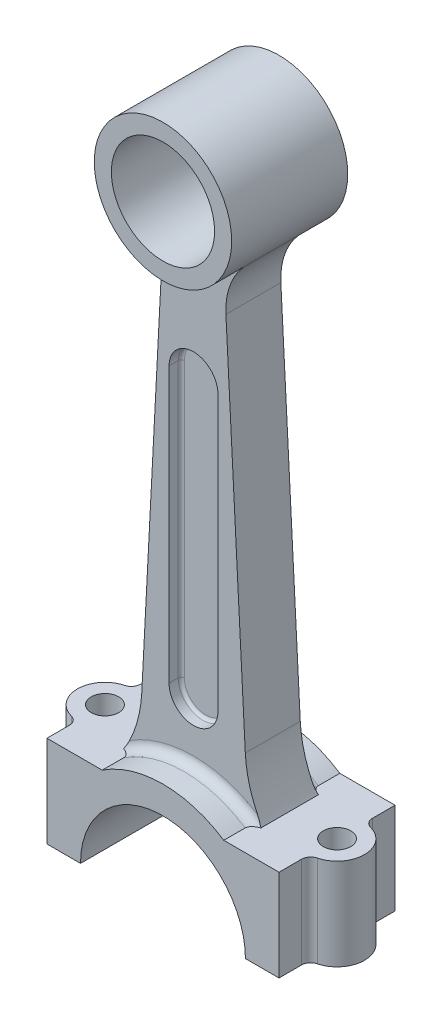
ISO-10303-21;
HEADER;
FILE_DESCRIPTION(('STEP AP214'),'2;1');
FILE_NAME('part.step','',(''),(''),'','','');
FILE_SCHEMA(('AUTOMOTIVE_DESIGN { 1 0 10303 214 1 1 1 1 }'));
ENDSEC;
DATA;
#1=APPLICATION_CONTEXT('core data for automotive mechanical design processes');
#2=APPLICATION_PROTOCOL_DEFINITION('international standard','automotive_design',2000,#1);
#3=PRODUCT_CONTEXT('',#1,'mechanical');
#4=PRODUCT('Part','Part','',(#3));
#5=PRODUCT_RELATED_PRODUCT_CATEGORY('part','',(#4));
#6=PRODUCT_DEFINITION_FORMATION('','',#4);
#7=PRODUCT_DEFINITION_CONTEXT('part definition',#1,'design');
#8=PRODUCT_DEFINITION('design','',#6,#7);
#9=PRODUCT_DEFINITION_SHAPE('','',#8);
#10=(LENGTH_UNIT() NAMED_UNIT(*) SI_UNIT(.MILLI.,.METRE.));
#11=(NAMED_UNIT(*) PLANE_ANGLE_UNIT() SI_UNIT($,.RADIAN.));
#12=(NAMED_UNIT(*) SI_UNIT($,.STERADIAN.) SOLID_ANGLE_UNIT());
#13=UNCERTAINTY_MEASURE_WITH_UNIT(LENGTH_MEASURE(1.E-05),#10,'distance_accuracy_value','');
#14=(GEOMETRIC_REPRESENTATION_CONTEXT(3) GLOBAL_UNCERTAINTY_ASSIGNED_CONTEXT((#13)) GLOBAL_UNIT_ASSIGNED_CONTEXT((#10,
#11,#12)) REPRESENTATION_CONTEXT('',''));
#15=CARTESIAN_POINT('',(0.,0.,0.));
#16=DIRECTION('',(0.,0.,1.));
#17=DIRECTION('',(1.,0.,0.));
#18=AXIS2_PLACEMENT_3D('',#15,#16,#17);
#19=CARTESIAN_POINT('',(0.,0.,-9.));
#20=DIRECTION('',(0.,0.,1.));
#21=DIRECTION('',(1.,0.,0.));
#22=AXIS2_PLACEMENT_3D('',#19,#20,#21);
#23=PLANE('',#22);
#24=CARTESIAN_POINT('',(56.9027580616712,50.379322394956,-9.));
#25=DIRECTION('',(0.,0.,1.));
#26=DIRECTION('',(1.,0.,0.));
#27=AXIS2_PLACEMENT_3D('',#24,#25,#26);
#28=CIRCLE('',#27,40.);
#29=CARTESIAN_POINT('',(16.9575766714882,48.2858841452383,-9.));
#30=VERTEX_POINT('',#29);
#31=CARTESIAN_POINT('',(20.9156720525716,32.9170876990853,-9.));
#32=VERTEX_POINT('',#31);
#33=EDGE_CURVE('E629',#30,#32,#28,.T.);
#34=ORIENTED_EDGE('',*,*,#33,.T.);
#35=CARTESIAN_POINT('',(0.,0.,-9.));
#36=DIRECTION('',(0.,0.,1.));
#37=DIRECTION('',(1.,0.,0.));
#38=AXIS2_PLACEMENT_3D('',#35,#36,#37);
#39=CIRCLE('',#38,39.);
#40=CARTESIAN_POINT('',(-20.9156720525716,32.9170876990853,-9.));
#41=VERTEX_POINT('',#40);
#42=EDGE_CURVE('E624',#32,#41,#39,.T.);
#43=ORIENTED_EDGE('',*,*,#42,.T.);
#44=CARTESIAN_POINT('',(-56.9027580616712,50.379322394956,-9.));
#45=DIRECTION('',(0.,0.,1.));
#46=DIRECTION('',(1.,0.,0.));
#47=AXIS2_PLACEMENT_3D('',#44,#45,#46);
#48=CIRCLE('',#47,40.);
#49=CARTESIAN_POINT('',(-16.9575766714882,48.2858841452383,-9.));
#50=VERTEX_POINT('',#49);
#51=EDGE_CURVE('E641',#41,#50,#48,.T.);
#52=ORIENTED_EDGE('',*,*,#51,.T.);
#53=DIRECTION('',(-0.052335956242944,-0.998629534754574,0.));
#54=VECTOR('',#53,1.);
#55=CARTESIAN_POINT('',(-19.4347536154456,1.01853227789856,-9.));
#56=LINE('',#55,#54);
#57=CARTESIAN_POINT('',(-10.6045909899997,169.508072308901,-9.));
#58=VERTEX_POINT('',#57);
#59=EDGE_CURVE('E695',#58,#50,#56,.T.);
#60=ORIENTED_EDGE('',*,*,#59,.F.);
#61=CARTESIAN_POINT('',(-33.0737555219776,170.685631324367,-9.));
#62=DIRECTION('',(0.,0.,1.));
#63=DIRECTION('',(1.,0.,0.));
#64=AXIS2_PLACEMENT_3D('',#61,#62,#63);
#65=CIRCLE('',#64,22.5);
#66=CARTESIAN_POINT('',(-16.5368777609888,185.942815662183,-9.));
#67=VERTEX_POINT('',#66);
#68=EDGE_CURVE('E655',#58,#67,#65,.T.);
#69=ORIENTED_EDGE('',*,*,#68,.T.);
#70=CARTESIAN_POINT('',(0.,201.2,-9.));
#71=DIRECTION('',(0.,0.,1.));
#72=DIRECTION('',(1.,0.,0.));
#73=AXIS2_PLACEMENT_3D('',#70,#71,#72);
#74=CIRCLE('',#73,22.5);
#75=CARTESIAN_POINT('',(16.5368777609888,185.942815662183,-9.));
#76=VERTEX_POINT('',#75);
#77=EDGE_CURVE('E698',#67,#76,#74,.T.);
#78=ORIENTED_EDGE('',*,*,#77,.T.);
#79=CARTESIAN_POINT('',(33.0737555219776,170.685631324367,-9.));
#80=DIRECTION('',(0.,0.,1.));
#81=DIRECTION('',(1.,0.,0.));
#82=AXIS2_PLACEMENT_3D('',#79,#80,#81);
#83=CIRCLE('',#82,22.5);
#84=CARTESIAN_POINT('',(10.6045909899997,169.508072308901,-9.));
#85=VERTEX_POINT('',#84);
#86=EDGE_CURVE('E660',#76,#85,#83,.T.);
#87=ORIENTED_EDGE('',*,*,#86,.T.);
#88=DIRECTION('',(0.052335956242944,-0.998629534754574,0.));
#89=VECTOR('',#88,1.);
#90=CARTESIAN_POINT('',(19.4347536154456,1.01853227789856,-9.));
#91=LINE('',#90,#89);
#92=EDGE_CURVE('E634',#85,#30,#91,.T.);
#93=ORIENTED_EDGE('',*,*,#92,.T.);
#94=EDGE_LOOP('',(#34,#43,#52,#60,#69,#78,#87,#93));
#95=FACE_BOUND('',#94,.T.);
#96=CARTESIAN_POINT('',(0.,145.6,-9.));
#97=DIRECTION('',(0.,0.,1.));
#98=DIRECTION('',(1.,0.,0.));
#99=AXIS2_PLACEMENT_3D('',#96,#97,#98);
#100=CIRCLE('',#99,8.);
#101=CARTESIAN_POINT('',(8.00000000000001,145.6,-9.));
#102=VERTEX_POINT('',#101);
#103=CARTESIAN_POINT('',(-7.99999999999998,145.6,-9.));
#104=VERTEX_POINT('',#103);
#105=EDGE_CURVE('E324',#102,#104,#100,.T.);
#106=ORIENTED_EDGE('',*,*,#105,.T.);
#107=DIRECTION('',(0.,-1.,0.));
#108=VECTOR('',#107,1.);
#109=CARTESIAN_POINT('',(-7.99999999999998,145.6,-9.));
#110=LINE('',#109,#108);
#111=CARTESIAN_POINT('',(-7.99999999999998,55.6,-9.));
#112=VERTEX_POINT('',#111);
#113=EDGE_CURVE('E327',#104,#112,#110,.T.);
#114=ORIENTED_EDGE('',*,*,#113,.T.);
#115=CARTESIAN_POINT('',(0.,55.6,-9.));
#116=DIRECTION('',(0.,0.,1.));
#117=DIRECTION('',(1.,0.,0.));
#118=AXIS2_PLACEMENT_3D('',#115,#116,#117);
#119=CIRCLE('',#118,8.);
#120=CARTESIAN_POINT('',(8.00000000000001,55.6,-9.));
#121=VERTEX_POINT('',#120);
#122=EDGE_CURVE('E308',#112,#121,#119,.T.);
#123=ORIENTED_EDGE('',*,*,#122,.T.);
#124=DIRECTION('',(0.,-1.,0.));
#125=VECTOR('',#124,1.);
#126=CARTESIAN_POINT('',(8.00000000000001,145.6,-9.));
#127=LINE('',#126,#125);
#128=EDGE_CURVE('E319',#102,#121,#127,.T.);
#129=ORIENTED_EDGE('',*,*,#128,.F.);
#130=EDGE_LOOP('',(#106,#114,#123,#129));
#131=FACE_BOUND('',#130,.T.);
#132=ADVANCED_FACE('F35',(#95,#131),#23,.F.);
#133=CARTESIAN_POINT('',(0.,0.,19.));
#134=DIRECTION('',(0.,1.,0.));
#135=DIRECTION('',(0.,0.,1.));
#136=AXIS2_PLACEMENT_3D('',#133,#134,#135);
#137=PLANE('',#136);
#138=CARTESIAN_POINT('',(38.,0.,0.));
#139=DIRECTION('',(0.,-1.,0.));
#140=DIRECTION('',(0.,0.,1.));
#141=AXIS2_PLACEMENT_3D('',#138,#139,#140);
#142=CIRCLE('',#141,4.5);
#143=CARTESIAN_POINT('',(36.,0.,-4.03112887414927));
#144=VERTEX_POINT('',#143);
#145=CARTESIAN_POINT('',(36.,0.,4.03112887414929));
#146=VERTEX_POINT('',#145);
#147=EDGE_CURVE('E366',#144,#146,#142,.T.);
#148=ORIENTED_EDGE('',*,*,#147,.F.);
#149=DIRECTION('',(0.,0.,-1.));
#150=VECTOR('',#149,1.);
#151=CARTESIAN_POINT('',(36.,0.,19.));
#152=LINE('',#151,#150);
#153=EDGE_CURVE('E714',#146,#144,#152,.T.);
#154=ORIENTED_EDGE('',*,*,#153,.F.);
#155=EDGE_LOOP('',(#148,#154));
#156=FACE_BOUND('',#155,.T.);
#157=DIRECTION('',(0.,0.,-1.));
#158=VECTOR('',#157,1.);
#159=CARTESIAN_POINT('',(27.,0.,318.255929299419));
#160=LINE('',#159,#158);
#161=CARTESIAN_POINT('',(27.,0.,19.));
#162=VERTEX_POINT('',#161);
#163=CARTESIAN_POINT('',(27.,0.,-19.));
#164=VERTEX_POINT('',#163);
#165=EDGE_CURVE('E353',#162,#164,#160,.T.);
#166=ORIENTED_EDGE('',*,*,#165,.T.);
#167=DIRECTION('',(1.,0.,0.));
#168=VECTOR('',#167,1.);
#169=CARTESIAN_POINT('',(0.,0.,-19.));
#170=LINE('',#169,#168);
#171=CARTESIAN_POINT('',(38.,0.,-19.));
#172=VERTEX_POINT('',#171);
#173=EDGE_CURVE('E491',#164,#172,#170,.T.);
#174=ORIENTED_EDGE('',*,*,#173,.T.);
#175=DIRECTION('',(0.,0.,1.));
#176=VECTOR('',#175,1.);
#177=CARTESIAN_POINT('',(38.,0.,-19.));
#178=LINE('',#177,#176);
#179=CARTESIAN_POINT('',(38.,0.,-11.6189500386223));
#180=VERTEX_POINT('',#179);
#181=EDGE_CURVE('E432',#172,#180,#178,.T.);
#182=ORIENTED_EDGE('',*,*,#181,.T.);
#183=CARTESIAN_POINT('',(41.,0.,-11.6189500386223));
#184=DIRECTION('',(0.,1.,0.));
#185=DIRECTION('',(0.,0.,1.));
#186=AXIS2_PLACEMENT_3D('',#183,#184,#185);
#187=CIRCLE('',#186,3.);
#188=CARTESIAN_POINT('',(40.25,0.,-8.7142125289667));
#189=VERTEX_POINT('',#188);
#190=EDGE_CURVE('E435',#180,#189,#187,.T.);
#191=ORIENTED_EDGE('',*,*,#190,.T.);
#192=CARTESIAN_POINT('',(38.,0.,0.));
#193=DIRECTION('',(0.,-1.,0.));
#194=DIRECTION('',(0.,0.,1.));
#195=AXIS2_PLACEMENT_3D('',#192,#193,#194);
#196=CIRCLE('',#195,9.00000000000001);
#197=CARTESIAN_POINT('',(40.25,0.,8.71421252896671));
#198=VERTEX_POINT('',#197);
#199=EDGE_CURVE('E438',#189,#198,#196,.T.);
#200=ORIENTED_EDGE('',*,*,#199,.T.);
#201=CARTESIAN_POINT('',(41.,0.,11.6189500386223));
#202=DIRECTION('',(0.,1.,0.));
#203=DIRECTION('',(0.,0.,-1.));
#204=AXIS2_PLACEMENT_3D('',#201,#202,#203);
#205=CIRCLE('',#204,3.);
#206=CARTESIAN_POINT('',(38.,0.,11.6189500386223));
#207=VERTEX_POINT('',#206);
#208=EDGE_CURVE('E441',#198,#207,#205,.T.);
#209=ORIENTED_EDGE('',*,*,#208,.T.);
#210=DIRECTION('',(0.,0.,1.));
#211=VECTOR('',#210,1.);
#212=CARTESIAN_POINT('',(38.,0.,19.));
#213=LINE('',#212,#211);
#214=CARTESIAN_POINT('',(38.,0.,19.));
#215=VERTEX_POINT('',#214);
#216=EDGE_CURVE('E444',#207,#215,#213,.T.);
#217=ORIENTED_EDGE('',*,*,#216,.T.);
#218=DIRECTION('',(-1.,0.,0.));
#219=VECTOR('',#218,1.);
#220=CARTESIAN_POINT('',(0.,0.,19.));
#221=LINE('',#220,#219);
#222=EDGE_CURVE('E723',#215,#162,#221,.T.);
#223=ORIENTED_EDGE('',*,*,#222,.T.);
#224=EDGE_LOOP('',(#166,#174,#182,#191,#200,#209,#217,#223));
#225=FACE_BOUND('',#224,.T.);
#226=ADVANCED_FACE('F750',(#156,#225),#137,.F.);
#227=CARTESIAN_POINT('',(-38.,0.,0.));
#228=DIRECTION('',(0.,-1.,0.));
#229=DIRECTION('',(0.,0.,-1.));
#230=AXIS2_PLACEMENT_3D('',#227,#228,#229);
#231=CIRCLE('',#230,4.5);
#232=CARTESIAN_POINT('',(-36.,0.,4.03112887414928));
#233=VERTEX_POINT('',#232);
#234=CARTESIAN_POINT('',(-36.,0.,-4.03112887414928));
#235=VERTEX_POINT('',#234);
#236=EDGE_CURVE('E370',#233,#235,#231,.T.);
#237=ORIENTED_EDGE('',*,*,#236,.F.);
#238=DIRECTION('',(0.,0.,-1.));
#239=VECTOR('',#238,1.);
#240=CARTESIAN_POINT('',(-36.,0.,19.));
#241=LINE('',#240,#239);
#242=EDGE_CURVE('E720',#233,#235,#241,.T.);
#243=ORIENTED_EDGE('',*,*,#242,.T.);
#244=EDGE_LOOP('',(#237,#243));
#245=FACE_BOUND('',#244,.T.);
#246=DIRECTION('',(0.,0.,-1.));
#247=VECTOR('',#246,1.);
#248=CARTESIAN_POINT('',(-27.,0.,318.255929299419));
#249=LINE('',#248,#247);
#250=CARTESIAN_POINT('',(-27.,0.,19.));
#251=VERTEX_POINT('',#250);
#252=CARTESIAN_POINT('',(-27.,0.,-19.));
#253=VERTEX_POINT('',#252);
#254=EDGE_CURVE('E359',#251,#253,#249,.T.);
#255=ORIENTED_EDGE('',*,*,#254,.F.);
#256=CARTESIAN_POINT('',(-38.,0.,19.));
#257=VERTEX_POINT('',#256);
#258=EDGE_CURVE('E729',#251,#257,#221,.T.);
#259=ORIENTED_EDGE('',*,*,#258,.T.);
#260=DIRECTION('',(0.,0.,-1.));
#261=VECTOR('',#260,1.);
#262=CARTESIAN_POINT('',(-38.,0.,11.6189500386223));
#263=LINE('',#262,#261);
#264=CARTESIAN_POINT('',(-38.,0.,11.6189500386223));
#265=VERTEX_POINT('',#264);
#266=EDGE_CURVE('E376',#257,#265,#263,.T.);
#267=ORIENTED_EDGE('',*,*,#266,.T.);
#268=CARTESIAN_POINT('',(-41.,0.,11.6189500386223));
#269=DIRECTION('',(0.,1.,0.));
#270=DIRECTION('',(0.,0.,1.));
#271=AXIS2_PLACEMENT_3D('',#268,#269,#270);
#272=CIRCLE('',#271,3.);
#273=CARTESIAN_POINT('',(-40.25,0.,8.71421252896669));
#274=VERTEX_POINT('',#273);
#275=EDGE_CURVE('E420',#265,#274,#272,.T.);
#276=ORIENTED_EDGE('',*,*,#275,.T.);
#277=CARTESIAN_POINT('',(-38.,0.,0.));
#278=DIRECTION('',(0.,-1.,0.));
#279=DIRECTION('',(0.,0.,-1.));
#280=AXIS2_PLACEMENT_3D('',#277,#278,#279);
#281=CIRCLE('',#280,9.);
#282=CARTESIAN_POINT('',(-40.25,0.,-8.71421252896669));
#283=VERTEX_POINT('',#282);
#284=EDGE_CURVE('E423',#274,#283,#281,.T.);
#285=ORIENTED_EDGE('',*,*,#284,.T.);
#286=CARTESIAN_POINT('',(-41.,0.,-11.6189500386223));
#287=DIRECTION('',(0.,1.,0.));
#288=DIRECTION('',(0.,0.,-1.));
#289=AXIS2_PLACEMENT_3D('',#286,#287,#288);
#290=CIRCLE('',#289,3.);
#291=CARTESIAN_POINT('',(-38.,0.,-11.6189500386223));
#292=VERTEX_POINT('',#291);
#293=EDGE_CURVE('E426',#283,#292,#290,.T.);
#294=ORIENTED_EDGE('',*,*,#293,.T.);
#295=DIRECTION('',(0.,0.,-1.));
#296=VECTOR('',#295,1.);
#297=CARTESIAN_POINT('',(-38.,0.,-11.6189500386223));
#298=LINE('',#297,#296);
#299=CARTESIAN_POINT('',(-38.,0.,-19.));
#300=VERTEX_POINT('',#299);
#301=EDGE_CURVE('E429',#292,#300,#298,.T.);
#302=ORIENTED_EDGE('',*,*,#301,.T.);
#303=EDGE_CURVE('E726',#300,#253,#170,.T.);
#304=ORIENTED_EDGE('',*,*,#303,.T.);
#305=EDGE_LOOP('',(#255,#259,#267,#276,#285,#294,#302,#304));
#306=FACE_BOUND('',#305,.T.);
#307=ADVANCED_FACE('F875',(#245,#306),#137,.F.);
#308=CARTESIAN_POINT('',(0.,0.,19.));
#309=DIRECTION('',(0.,0.,1.));
#310=DIRECTION('',(1.,0.,0.));
#311=AXIS2_PLACEMENT_3D('',#308,#309,#310);
#312=PLANE('',#311);
#313=ORIENTED_EDGE('',*,*,#258,.F.);
#314=CARTESIAN_POINT('',(0.,0.,19.));
#315=DIRECTION('',(0.,0.,1.));
#316=DIRECTION('',(1.,0.,0.));
#317=AXIS2_PLACEMENT_3D('',#314,#315,#316);
#318=CIRCLE('',#317,27.);
#319=EDGE_CURVE('E362',#251,#162,#318,.F.);
#320=ORIENTED_EDGE('',*,*,#319,.T.);
#321=ORIENTED_EDGE('',*,*,#222,.F.);
#322=DIRECTION('',(0.,-1.,0.));
#323=VECTOR('',#322,1.);
#324=CARTESIAN_POINT('',(38.,30.,19.));
#325=LINE('',#324,#323);
#326=CARTESIAN_POINT('',(38.,30.,19.));
#327=VERTEX_POINT('',#326);
#328=EDGE_CURVE('E447',#327,#215,#325,.T.);
#329=ORIENTED_EDGE('',*,*,#328,.F.);
#330=DIRECTION('',(-1.,0.,0.));
#331=VECTOR('',#330,1.);
#332=CARTESIAN_POINT('',(-38.,30.,19.));
#333=LINE('',#332,#331);
#334=CARTESIAN_POINT('',(19.8997487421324,30.,19.));
#335=VERTEX_POINT('',#334);
#336=EDGE_CURVE('E379',#327,#335,#333,.T.);
#337=ORIENTED_EDGE('',*,*,#336,.T.);
#338=CARTESIAN_POINT('',(0.,0.,19.));
#339=DIRECTION('',(0.,0.,1.));
#340=DIRECTION('',(1.,0.,0.));
#341=AXIS2_PLACEMENT_3D('',#338,#339,#340);
#342=CIRCLE('',#341,36.);
#343=CARTESIAN_POINT('',(-19.8997487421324,30.,19.));
#344=VERTEX_POINT('',#343);
#345=EDGE_CURVE('E492',#335,#344,#342,.T.);
#346=ORIENTED_EDGE('',*,*,#345,.T.);
#347=CARTESIAN_POINT('',(-38.,30.,19.));
#348=VERTEX_POINT('',#347);
#349=EDGE_CURVE('E383',#344,#348,#333,.T.);
#350=ORIENTED_EDGE('',*,*,#349,.T.);
#351=DIRECTION('',(0.,-1.,0.));
#352=VECTOR('',#351,1.);
#353=CARTESIAN_POINT('',(-38.,30.,19.));
#354=LINE('',#353,#352);
#355=EDGE_CURVE('E417',#348,#257,#354,.T.);
#356=ORIENTED_EDGE('',*,*,#355,.T.);
#357=EDGE_LOOP('',(#313,#320,#321,#329,#337,#346,#350,#356));
#358=FACE_BOUND('',#357,.T.);
#359=ADVANCED_FACE('F738',(#358),#312,.T.);
#360=CARTESIAN_POINT('',(0.,0.,-19.));
#361=DIRECTION('',(0.,0.,1.));
#362=DIRECTION('',(1.,0.,0.));
#363=AXIS2_PLACEMENT_3D('',#360,#361,#362);
#364=PLANE('',#363);
#365=CARTESIAN_POINT('',(0.,0.,-19.));
#366=DIRECTION('',(0.,0.,1.));
#367=DIRECTION('',(1.,0.,0.));
#368=AXIS2_PLACEMENT_3D('',#365,#366,#367);
#369=CIRCLE('',#368,27.);
#370=EDGE_CURVE('E673',#253,#164,#369,.F.);
#371=ORIENTED_EDGE('',*,*,#370,.F.);
#372=ORIENTED_EDGE('',*,*,#303,.F.);
#373=DIRECTION('',(0.,-1.,0.));
#374=VECTOR('',#373,1.);
#375=CARTESIAN_POINT('',(-38.,30.,-19.));
#376=LINE('',#375,#374);
#377=CARTESIAN_POINT('',(-38.,30.,-19.));
#378=VERTEX_POINT('',#377);
#379=EDGE_CURVE('E462',#378,#300,#376,.T.);
#380=ORIENTED_EDGE('',*,*,#379,.F.);
#381=DIRECTION('',(1.,0.,0.));
#382=VECTOR('',#381,1.);
#383=CARTESIAN_POINT('',(-38.,30.,-19.));
#384=LINE('',#383,#382);
#385=CARTESIAN_POINT('',(-19.8997487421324,30.,-19.));
#386=VERTEX_POINT('',#385);
#387=EDGE_CURVE('E399',#378,#386,#384,.T.);
#388=ORIENTED_EDGE('',*,*,#387,.T.);
#389=CARTESIAN_POINT('',(0.,0.,-19.));
#390=DIRECTION('',(0.,0.,1.));
#391=DIRECTION('',(1.,0.,0.));
#392=AXIS2_PLACEMENT_3D('',#389,#390,#391);
#393=CIRCLE('',#392,36.);
#394=CARTESIAN_POINT('',(19.8997487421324,30.,-19.));
#395=VERTEX_POINT('',#394);
#396=EDGE_CURVE('E724',#395,#386,#393,.T.);
#397=ORIENTED_EDGE('',*,*,#396,.F.);
#398=CARTESIAN_POINT('',(38.,30.,-19.));
#399=VERTEX_POINT('',#398);
#400=EDGE_CURVE('E398',#395,#399,#384,.T.);
#401=ORIENTED_EDGE('',*,*,#400,.T.);
#402=DIRECTION('',(0.,-1.,0.));
#403=VECTOR('',#402,1.);
#404=CARTESIAN_POINT('',(38.,30.,-19.));
#405=LINE('',#404,#403);
#406=EDGE_CURVE('E459',#399,#172,#405,.T.);
#407=ORIENTED_EDGE('',*,*,#406,.T.);
#408=ORIENTED_EDGE('',*,*,#173,.F.);
#409=EDGE_LOOP('',(#371,#372,#380,#388,#397,#401,#407,#408));
#410=FACE_BOUND('',#409,.T.);
#411=ADVANCED_FACE('F754',(#410),#364,.F.);
#412=CARTESIAN_POINT('',(0.,0.,9.));
#413=DIRECTION('',(0.,0.,1.));
#414=DIRECTION('',(1.,0.,0.));
#415=AXIS2_PLACEMENT_3D('',#412,#413,#414);
#416=PLANE('',#415);
#417=CARTESIAN_POINT('',(0.,145.6,9.));
#418=DIRECTION('',(0.,0.,1.));
#419=DIRECTION('',(1.,0.,0.));
#420=AXIS2_PLACEMENT_3D('',#417,#418,#419);
#421=CIRCLE('',#420,8.);
#422=CARTESIAN_POINT('',(8.00000000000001,145.6,9.));
#423=VERTEX_POINT('',#422);
#424=CARTESIAN_POINT('',(-7.99999999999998,145.6,9.));
#425=VERTEX_POINT('',#424);
#426=EDGE_CURVE('E337',#423,#425,#421,.T.);
#427=ORIENTED_EDGE('',*,*,#426,.F.);
#428=DIRECTION('',(0.,-1.,0.));
#429=VECTOR('',#428,1.);
#430=CARTESIAN_POINT('',(8.00000000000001,145.6,9.));
#431=LINE('',#430,#429);
#432=CARTESIAN_POINT('',(8.00000000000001,55.6,9.));
#433=VERTEX_POINT('',#432);
#434=EDGE_CURVE('E347',#423,#433,#431,.T.);
#435=ORIENTED_EDGE('',*,*,#434,.T.);
#436=CARTESIAN_POINT('',(0.,55.6,9.));
#437=DIRECTION('',(0.,0.,1.));
#438=DIRECTION('',(1.,0.,0.));
#439=AXIS2_PLACEMENT_3D('',#436,#437,#438);
#440=CIRCLE('',#439,8.);
#441=CARTESIAN_POINT('',(-7.99999999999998,55.6,9.));
#442=VERTEX_POINT('',#441);
#443=EDGE_CURVE('E344',#442,#433,#440,.T.);
#444=ORIENTED_EDGE('',*,*,#443,.F.);
#445=DIRECTION('',(0.,-1.,0.));
#446=VECTOR('',#445,1.);
#447=CARTESIAN_POINT('',(-7.99999999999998,145.6,9.));
#448=LINE('',#447,#446);
#449=EDGE_CURVE('E340',#425,#442,#448,.T.);
#450=ORIENTED_EDGE('',*,*,#449,.F.);
#451=EDGE_LOOP('',(#427,#435,#444,#450));
#452=FACE_BOUND('',#451,.T.);
#453=CARTESIAN_POINT('',(-56.9027580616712,50.379322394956,9.));
#454=DIRECTION('',(0.,0.,1.));
#455=DIRECTION('',(1.,0.,0.));
#456=AXIS2_PLACEMENT_3D('',#453,#454,#455);
#457=CIRCLE('',#456,40.);
#458=CARTESIAN_POINT('',(-16.9575766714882,48.2858841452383,9.));
#459=VERTEX_POINT('',#458);
#460=CARTESIAN_POINT('',(-20.9156720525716,32.9170876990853,9.));
#461=VERTEX_POINT('',#460);
#462=EDGE_CURVE('E636',#459,#461,#457,.F.);
#463=ORIENTED_EDGE('',*,*,#462,.T.);
#464=CARTESIAN_POINT('',(0.,0.,9.));
#465=DIRECTION('',(0.,0.,1.));
#466=DIRECTION('',(1.,0.,0.));
#467=AXIS2_PLACEMENT_3D('',#464,#465,#466);
#468=CIRCLE('',#467,39.);
#469=CARTESIAN_POINT('',(20.9156720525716,32.9170876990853,9.));
#470=VERTEX_POINT('',#469);
#471=EDGE_CURVE('E605',#461,#470,#468,.F.);
#472=ORIENTED_EDGE('',*,*,#471,.T.);
#473=CARTESIAN_POINT('',(56.9027580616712,50.379322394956,9.));
#474=DIRECTION('',(0.,0.,1.));
#475=DIRECTION('',(1.,0.,0.));
#476=AXIS2_PLACEMENT_3D('',#473,#474,#475);
#477=CIRCLE('',#476,40.);
#478=CARTESIAN_POINT('',(16.9575766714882,48.2858841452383,9.));
#479=VERTEX_POINT('',#478);
#480=EDGE_CURVE('E635',#470,#479,#477,.F.);
#481=ORIENTED_EDGE('',*,*,#480,.T.);
#482=DIRECTION('',(0.052335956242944,-0.998629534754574,0.));
#483=VECTOR('',#482,1.);
#484=CARTESIAN_POINT('',(19.4347536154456,1.01853227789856,9.));
#485=LINE('',#484,#483);
#486=CARTESIAN_POINT('',(10.6045909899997,169.508072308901,9.));
#487=VERTEX_POINT('',#486);
#488=EDGE_CURVE('E697',#487,#479,#485,.T.);
#489=ORIENTED_EDGE('',*,*,#488,.F.);
#490=CARTESIAN_POINT('',(33.0737555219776,170.685631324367,9.));
#491=DIRECTION('',(0.,0.,1.));
#492=DIRECTION('',(1.,0.,0.));
#493=AXIS2_PLACEMENT_3D('',#490,#491,#492);
#494=CIRCLE('',#493,22.5);
#495=CARTESIAN_POINT('',(16.5368777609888,185.942815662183,9.));
#496=VERTEX_POINT('',#495);
#497=EDGE_CURVE('E662',#487,#496,#494,.F.);
#498=ORIENTED_EDGE('',*,*,#497,.T.);
#499=CARTESIAN_POINT('',(0.,201.2,9.));
#500=DIRECTION('',(0.,0.,1.));
#501=DIRECTION('',(1.,0.,0.));
#502=AXIS2_PLACEMENT_3D('',#499,#500,#501);
#503=CIRCLE('',#502,22.5);
#504=CARTESIAN_POINT('',(-16.5368777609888,185.942815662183,9.));
#505=VERTEX_POINT('',#504);
#506=EDGE_CURVE('E703',#505,#496,#503,.T.);
#507=ORIENTED_EDGE('',*,*,#506,.F.);
#508=CARTESIAN_POINT('',(-33.0737555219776,170.685631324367,9.));
#509=DIRECTION('',(0.,0.,1.));
#510=DIRECTION('',(1.,0.,0.));
#511=AXIS2_PLACEMENT_3D('',#508,#509,#510);
#512=CIRCLE('',#511,22.5);
#513=CARTESIAN_POINT('',(-10.6045909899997,169.508072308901,9.));
#514=VERTEX_POINT('',#513);
#515=EDGE_CURVE('E658',#505,#514,#512,.F.);
#516=ORIENTED_EDGE('',*,*,#515,.T.);
#517=DIRECTION('',(-0.052335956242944,-0.998629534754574,0.));
#518=VECTOR('',#517,1.);
#519=CARTESIAN_POINT('',(-19.4347536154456,1.01853227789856,9.));
#520=LINE('',#519,#518);
#521=EDGE_CURVE('E694',#514,#459,#520,.T.);
#522=ORIENTED_EDGE('',*,*,#521,.T.);
#523=EDGE_LOOP('',(#463,#472,#481,#489,#498,#507,#516,#522));
#524=FACE_BOUND('',#523,.T.);
#525=ADVANCED_FACE('F777',(#452,#524),#416,.T.);
#526=CARTESIAN_POINT('',(0.,0.,19.));
#527=DIRECTION('',(0.,0.,-1.));
#528=DIRECTION('',(-1.,0.,0.));
#529=AXIS2_PLACEMENT_3D('',#526,#527,#528);
#530=CYLINDRICAL_SURFACE('',#529,36.);
#531=DIRECTION('',(0.,0.,-1.));
#532=VECTOR('',#531,1.);
#533=CARTESIAN_POINT('',(19.8997487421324,30.,19.));
#534=LINE('',#533,#532);
#535=CARTESIAN_POINT('',(19.8997487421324,30.,12.));
#536=VERTEX_POINT('',#535);
#537=EDGE_CURVE('E450',#536,#335,#534,.F.);
#538=ORIENTED_EDGE('',*,*,#537,.F.);
#539=CARTESIAN_POINT('',(0.,0.,12.));
#540=DIRECTION('',(0.,0.,1.));
#541=DIRECTION('',(1.,0.,0.));
#542=AXIS2_PLACEMENT_3D('',#539,#540,#541);
#543=CIRCLE('',#542,36.);
#544=CARTESIAN_POINT('',(-19.8997487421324,30.,12.));
#545=VERTEX_POINT('',#544);
#546=EDGE_CURVE('E606',#536,#545,#543,.T.);
#547=ORIENTED_EDGE('',*,*,#546,.T.);
#548=DIRECTION('',(0.,0.,-1.));
#549=VECTOR('',#548,1.);
#550=CARTESIAN_POINT('',(-19.8997487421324,30.,19.));
#551=LINE('',#550,#549);
#552=EDGE_CURVE('E481',#344,#545,#551,.T.);
#553=ORIENTED_EDGE('',*,*,#552,.F.);
#554=ORIENTED_EDGE('',*,*,#345,.F.);
#555=EDGE_LOOP('',(#538,#547,#553,#554));
#556=FACE_BOUND('',#555,.T.);
#557=ADVANCED_FACE('F494',(#556),#530,.T.);
#558=CARTESIAN_POINT('',(-19.8997487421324,30.,-12.));
#559=VERTEX_POINT('',#558);
#560=EDGE_CURVE('E479',#559,#386,#551,.T.);
#561=ORIENTED_EDGE('',*,*,#560,.F.);
#562=CARTESIAN_POINT('',(0.,0.,-12.));
#563=DIRECTION('',(0.,0.,1.));
#564=DIRECTION('',(1.,0.,0.));
#565=AXIS2_PLACEMENT_3D('',#562,#563,#564);
#566=CIRCLE('',#565,36.);
#567=CARTESIAN_POINT('',(19.8997487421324,30.,-12.));
#568=VERTEX_POINT('',#567);
#569=EDGE_CURVE('E544',#559,#568,#566,.F.);
#570=ORIENTED_EDGE('',*,*,#569,.T.);
#571=EDGE_CURVE('E476',#395,#568,#534,.F.);
#572=ORIENTED_EDGE('',*,*,#571,.F.);
#573=ORIENTED_EDGE('',*,*,#396,.T.);
#574=EDGE_LOOP('',(#561,#570,#572,#573));
#575=FACE_BOUND('',#574,.T.);
#576=ADVANCED_FACE('F681',(#575),#530,.T.);
#577=CARTESIAN_POINT('',(-36.,0.,-4.03112887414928));
#578=CARTESIAN_POINT('',(-36.0000000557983,0.188013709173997,-4.03112573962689));
#579=CARTESIAN_POINT('',(-35.998527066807,0.376023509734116,-4.03039853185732));
#580=CARTESIAN_POINT('',(-35.9926362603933,0.751984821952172,-4.02746896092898));
#581=CARTESIAN_POINT('',(-35.9882184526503,0.939936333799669,-4.02526660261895));
#582=CARTESIAN_POINT('',(-35.9705481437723,1.50367854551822,-4.01640551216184));
#583=CARTESIAN_POINT('',(-35.9528787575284,1.87930790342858,-4.00749275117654));
#584=CARTESIAN_POINT('',(-35.9056476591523,2.63203193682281,-3.98301390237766));
#585=CARTESIAN_POINT('',(-35.8760099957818,3.00912044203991,-3.96740528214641));
#586=CARTESIAN_POINT('',(-35.8049155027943,3.76176721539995,-3.92851743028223));
#587=CARTESIAN_POINT('',(-35.7634595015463,4.13732558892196,-3.90523873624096));
#588=CARTESIAN_POINT('',(-35.6679059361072,4.8937367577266,-3.84895882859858));
#589=CARTESIAN_POINT('',(-35.6135736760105,5.2745465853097,-3.8157737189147));
#590=CARTESIAN_POINT('',(-35.4929565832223,6.03303292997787,-3.73763305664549));
#591=CARTESIAN_POINT('',(-35.4266728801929,6.41070973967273,-3.69267861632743));
#592=CARTESIAN_POINT('',(-35.2826909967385,7.16079945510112,-3.58806098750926));
#593=CARTESIAN_POINT('',(-35.2050250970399,7.53322408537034,-3.52843908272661));
#594=CARTESIAN_POINT('',(-35.0803706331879,8.08724048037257,-3.42471121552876));
#595=CARTESIAN_POINT('',(-35.0374690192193,8.27110718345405,-3.38776133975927));
#596=CARTESIAN_POINT('',(-34.9490674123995,8.63701862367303,-3.30837604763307));
#597=CARTESIAN_POINT('',(-34.9035676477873,8.81906351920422,-3.26594111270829));
#598=CARTESIAN_POINT('',(-34.8136918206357,9.16715159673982,-3.17821877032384));
#599=CARTESIAN_POINT('',(-34.7694942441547,9.33335723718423,-3.13339498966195));
#600=CARTESIAN_POINT('',(-34.6791924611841,9.66348236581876,-3.03752828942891));
#601=CARTESIAN_POINT('',(-34.6330879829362,9.82740152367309,-2.98648448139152));
#602=CARTESIAN_POINT('',(-34.5392106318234,10.1524159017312,-2.87717425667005));
#603=CARTESIAN_POINT('',(-34.491437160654,10.3135100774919,-2.81890523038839));
#604=CARTESIAN_POINT('',(-34.3945966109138,10.6319990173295,-2.69394199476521));
#605=CARTESIAN_POINT('',(-34.3455297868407,10.789394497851,-2.62724943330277));
#606=CARTESIAN_POINT('',(-34.2560013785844,11.0699483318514,-2.49748812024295));
#607=CARTESIAN_POINT('',(-34.215672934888,11.1939378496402,-2.4361315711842));
#608=CARTESIAN_POINT('',(-34.1349152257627,11.4378340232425,-2.30586152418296));
#609=CARTESIAN_POINT('',(-34.0944859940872,11.5577418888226,-2.23695029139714));
#610=CARTESIAN_POINT('',(-34.0142215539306,11.7918610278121,-2.09057827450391));
#611=CARTESIAN_POINT('',(-33.9743847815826,11.9060904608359,-2.01314768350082));
#612=CARTESIAN_POINT('',(-33.8960206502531,12.1273875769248,-1.84815937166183));
#613=CARTESIAN_POINT('',(-33.8574920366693,12.2344622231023,-1.76061173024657));
#614=CARTESIAN_POINT('',(-33.7858661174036,12.4308204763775,-1.58103453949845));
#615=CARTESIAN_POINT('',(-33.7525799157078,12.520840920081,-1.48989744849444));
#616=CARTESIAN_POINT('',(-33.689520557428,12.6895355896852,-1.2962029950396));
#617=CARTESIAN_POINT('',(-33.6597508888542,12.7681985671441,-1.19363448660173));
#618=CARTESIAN_POINT('',(-33.6053919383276,12.9105973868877,-0.97483796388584));
#619=CARTESIAN_POINT('',(-33.5808848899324,12.9740978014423,-0.858431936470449));
#620=CARTESIAN_POINT('',(-33.5404603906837,13.0782534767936,-0.614487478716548));
#621=CARTESIAN_POINT('',(-33.5245122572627,13.1189903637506,-0.486990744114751));
#622=CARTESIAN_POINT('',(-33.5068054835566,13.1641320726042,-0.264149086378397));
#623=CARTESIAN_POINT('',(-33.5022430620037,13.1757245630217,-0.170467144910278));
#624=CARTESIAN_POINT('',(-33.4990542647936,13.1838307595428,0.0176593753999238));
#625=CARTESIAN_POINT('',(-33.5004261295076,13.1803489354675,0.112103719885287));
#626=CARTESIAN_POINT('',(-33.5089570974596,13.158644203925,0.298761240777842));
#627=CARTESIAN_POINT('',(-33.5161036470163,13.1404532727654,0.390978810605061));
#628=CARTESIAN_POINT('',(-33.5354798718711,13.0909238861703,0.571228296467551));
#629=CARTESIAN_POINT('',(-33.5477132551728,13.0595758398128,0.659257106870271));
#630=CARTESIAN_POINT('',(-33.5824563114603,12.9700342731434,0.866351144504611));
#631=CARTESIAN_POINT('',(-33.6071231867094,12.90609335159,0.982554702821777));
#632=CARTESIAN_POINT('',(-33.6622085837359,12.7617270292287,1.20272163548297));
#633=CARTESIAN_POINT('',(-33.6926414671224,12.681260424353,1.30665337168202));
#634=CARTESIAN_POINT('',(-33.7516657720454,12.523216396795,1.48627197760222));
#635=CARTESIAN_POINT('',(-33.7797014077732,12.4474425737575,1.5637656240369));
#636=CARTESIAN_POINT('',(-33.8374249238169,12.2896596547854,1.71150979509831));
#637=CARTESIAN_POINT('',(-33.8671139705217,12.2076461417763,1.78175510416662));
#638=CARTESIAN_POINT('',(-33.9275301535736,12.0387191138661,1.91582991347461));
#639=CARTESIAN_POINT('',(-33.9582587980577,11.9517983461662,1.97964950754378));
#640=CARTESIAN_POINT('',(-34.0202595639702,11.7741587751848,2.10150625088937));
#641=CARTESIAN_POINT('',(-34.0515318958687,11.683438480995,2.15954109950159));
#642=CARTESIAN_POINT('',(-34.1476831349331,11.4007053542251,2.32960776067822));
#643=CARTESIAN_POINT('',(-34.2128665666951,11.203759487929,2.43328671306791));
#644=CARTESIAN_POINT('',(-34.3420476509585,10.8013248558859,2.62346101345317));
#645=CARTESIAN_POINT('',(-34.4060439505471,10.5958271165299,2.70993773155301));
#646=CARTESIAN_POINT('',(-34.5318506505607,10.1783560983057,2.86919009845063));
#647=CARTESIAN_POINT('',(-34.593655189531,9.9663679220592,2.94193097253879));
#648=CARTESIAN_POINT('',(-34.7141798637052,9.53809311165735,3.07595307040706));
#649=CARTESIAN_POINT('',(-34.7729012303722,9.32180824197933,3.13723889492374));
#650=CARTESIAN_POINT('',(-34.8978759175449,8.84367300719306,3.26129088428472));
#651=CARTESIAN_POINT('',(-34.9633856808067,8.58110976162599,3.32204540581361));
#652=CARTESIAN_POINT('',(-35.088935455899,8.05235961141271,3.43259123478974));
#653=CARTESIAN_POINT('',(-35.1489740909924,7.78617181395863,3.48237978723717));
#654=CARTESIAN_POINT('',(-35.2633131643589,7.2507761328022,3.57293496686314));
#655=CARTESIAN_POINT('',(-35.3176078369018,6.9815655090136,3.61369257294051));
#656=CARTESIAN_POINT('',(-35.4201877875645,6.44096294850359,3.6876227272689));
#657=CARTESIAN_POINT('',(-35.4684727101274,6.16957088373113,3.72079482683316));
#658=CARTESIAN_POINT('',(-35.558922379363,5.62488318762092,3.78075170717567));
#659=CARTESIAN_POINT('',(-35.6010829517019,5.3515863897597,3.8075321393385));
#660=CARTESIAN_POINT('',(-35.6791510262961,4.80362134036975,3.85561399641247));
#661=CARTESIAN_POINT('',(-35.7150584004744,4.52895306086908,3.8769153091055));
#662=CARTESIAN_POINT('',(-35.780532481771,3.97871903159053,3.91476605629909));
#663=CARTESIAN_POINT('',(-35.8101032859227,3.70315397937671,3.93131856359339));
#664=CARTESIAN_POINT('',(-35.8628893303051,3.15119715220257,3.96025967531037));
#665=CARTESIAN_POINT('',(-35.8861043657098,2.87480535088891,3.97264814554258));
#666=CARTESIAN_POINT('',(-35.9374456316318,2.1652488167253,3.99964481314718));
#667=CARTESIAN_POINT('',(-35.9609504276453,1.73163238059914,4.01156049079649));
#668=CARTESIAN_POINT('',(-35.9844009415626,1.0815261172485,4.02335927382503));
#669=CARTESIAN_POINT('',(-35.9902500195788,0.865278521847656,4.02627992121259));
#670=CARTESIAN_POINT('',(-35.9980495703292,0.432689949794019,4.0301622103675));
#671=CARTESIAN_POINT('',(-35.999999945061,0.216348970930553,4.0311238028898));
#672=CARTESIAN_POINT('',(-36.,0.,4.03112887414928));
#673=B_SPLINE_CURVE_WITH_KNOTS('',3,(#577,#578,#579,#580,#581,#582,#583,#584,#585,#586,#587,
#588,#589,#590,#591,#592,#593,#594,#595,#596,#597,#598,#599,#600,#601,#602,#603,#604,#605,#606,
#607,#608,#609,#610,#611,#612,#613,#614,#615,#616,#617,#618,#619,#620,#621,#622,#623,#624,#625,
#626,#627,#628,#629,#630,#631,#632,#633,#634,#635,#636,#637,#638,#639,#640,#641,#642,#643,#644,
#645,#646,#647,#648,#649,#650,#651,#652,#653,#654,#655,#656,#657,#658,#659,#660,#661,#662,#663,
#664,#665,#666,#667,#668,#669,#670,#671,#672),.UNSPECIFIED.,.F.,.F.,(4,2,2,2,2,2,2,2,2,2,2,2,2,
2,2,2,2,2,2,2,2,2,2,2,2,2,2,2,2,2,2,2,2,2,2,2,2,2,2,2,2,2,2,2,2,2,2,4),(0.,0.564026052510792,
1.12805025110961,2.25624562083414,3.39171599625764,4.52710680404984,5.68504497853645,
6.84287376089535,7.99748022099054,8.5745588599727,9.15158688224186,9.68465326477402,
10.2177958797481,10.7511316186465,11.2843631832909,11.7164497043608,12.1484070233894,
12.5788799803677,13.0089277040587,13.4051898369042,13.8018417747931,14.2043014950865,
14.6053086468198,14.8875329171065,15.1696735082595,15.4512023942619,15.7329368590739,
16.1353793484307,16.5388377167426,16.8742168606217,17.2098356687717,17.5459642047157,
17.8822258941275,18.5767755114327,19.2720732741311,19.9691083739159,20.6658629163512,
21.4975462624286,22.329438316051,23.1621576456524,23.9949262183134,24.8282597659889,
25.6616103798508,26.4944205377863,27.3272575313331,28.6300782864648,29.2790818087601,
29.9281016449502),.UNSPECIFIED.);
#674=EDGE_CURVE('E482',#235,#233,#673,.T.);
#675=ORIENTED_EDGE('',*,*,#674,.F.);
#676=ORIENTED_EDGE('',*,*,#242,.F.);
#677=EDGE_LOOP('',(#675,#676));
#678=FACE_BOUND('',#677,.T.);
#679=ADVANCED_FACE('F903',(#678),#530,.T.);
#680=CARTESIAN_POINT('',(36.,0.,4.03112887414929));
#681=CARTESIAN_POINT('',(36.0000000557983,0.188013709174,4.0311257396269));
#682=CARTESIAN_POINT('',(35.998527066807,0.376023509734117,4.03039853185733));
#683=CARTESIAN_POINT('',(35.9926362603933,0.751984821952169,4.02746896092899));
#684=CARTESIAN_POINT('',(35.9882184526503,0.939936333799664,4.02526660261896));
#685=CARTESIAN_POINT('',(35.9705481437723,1.5036785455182,4.01640551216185));
#686=CARTESIAN_POINT('',(35.9528787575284,1.87930790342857,4.00749275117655));
#687=CARTESIAN_POINT('',(35.9056476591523,2.63203193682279,3.98301390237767));
#688=CARTESIAN_POINT('',(35.8760099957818,3.00912044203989,3.96740528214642));
#689=CARTESIAN_POINT('',(35.8049155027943,3.76176721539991,3.92851743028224));
#690=CARTESIAN_POINT('',(35.7634595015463,4.13732558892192,3.90523873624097));
#691=CARTESIAN_POINT('',(35.6679059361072,4.89373675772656,3.84895882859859));
#692=CARTESIAN_POINT('',(35.6135736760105,5.27454658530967,3.81577371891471));
#693=CARTESIAN_POINT('',(35.4929565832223,6.03303292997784,3.7376330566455));
#694=CARTESIAN_POINT('',(35.4266728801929,6.4107097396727,3.69267861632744));
#695=CARTESIAN_POINT('',(35.2826909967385,7.1607994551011,3.58806098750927));
#696=CARTESIAN_POINT('',(35.2050250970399,7.53322408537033,3.52843908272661));
#697=CARTESIAN_POINT('',(35.0803706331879,8.08724048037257,3.42471121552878));
#698=CARTESIAN_POINT('',(35.0374690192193,8.27110718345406,3.38776133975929));
#699=CARTESIAN_POINT('',(34.9490674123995,8.63701862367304,3.30837604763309));
#700=CARTESIAN_POINT('',(34.9035676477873,8.81906351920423,3.26594111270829));
#701=CARTESIAN_POINT('',(34.8136918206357,9.16715159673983,3.17821877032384));
#702=CARTESIAN_POINT('',(34.7694942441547,9.33335723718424,3.13339498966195));
#703=CARTESIAN_POINT('',(34.6791924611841,9.66348236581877,3.03752828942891));
#704=CARTESIAN_POINT('',(34.6330879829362,9.8274015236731,2.98648448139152));
#705=CARTESIAN_POINT('',(34.5392106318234,10.1524159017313,2.87717425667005));
#706=CARTESIAN_POINT('',(34.491437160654,10.3135100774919,2.8189052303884));
#707=CARTESIAN_POINT('',(34.3945966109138,10.6319990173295,2.69394199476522));
#708=CARTESIAN_POINT('',(34.3455297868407,10.789394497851,2.62724943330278));
#709=CARTESIAN_POINT('',(34.2560013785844,11.0699483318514,2.49748812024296));
#710=CARTESIAN_POINT('',(34.215672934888,11.1939378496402,2.43613157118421));
#711=CARTESIAN_POINT('',(34.1349152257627,11.4378340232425,2.30586152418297));
#712=CARTESIAN_POINT('',(34.0944859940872,11.5577418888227,2.23695029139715));
#713=CARTESIAN_POINT('',(34.0142215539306,11.7918610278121,2.09057827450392));
#714=CARTESIAN_POINT('',(33.9743847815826,11.9060904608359,2.01314768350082));
#715=CARTESIAN_POINT('',(33.8960206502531,12.1273875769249,1.84815937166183));
#716=CARTESIAN_POINT('',(33.8574920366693,12.2344622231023,1.76061173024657));
#717=CARTESIAN_POINT('',(33.7858661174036,12.4308204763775,1.58103453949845));
#718=CARTESIAN_POINT('',(33.7525799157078,12.520840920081,1.48989744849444));
#719=CARTESIAN_POINT('',(33.689520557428,12.6895355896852,1.29620299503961));
#720=CARTESIAN_POINT('',(33.6597508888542,12.7681985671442,1.19363448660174));
#721=CARTESIAN_POINT('',(33.6053919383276,12.9105973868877,0.974837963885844));
#722=CARTESIAN_POINT('',(33.5808848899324,12.9740978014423,0.858431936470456));
#723=CARTESIAN_POINT('',(33.5404603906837,13.0782534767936,0.614487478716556));
#724=CARTESIAN_POINT('',(33.5245122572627,13.1189903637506,0.486990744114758));
#725=CARTESIAN_POINT('',(33.5068054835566,13.1641320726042,0.264149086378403));
#726=CARTESIAN_POINT('',(33.5022430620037,13.1757245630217,0.170467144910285));
#727=CARTESIAN_POINT('',(33.4990542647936,13.1838307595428,-0.0176593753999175));
#728=CARTESIAN_POINT('',(33.5004261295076,13.1803489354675,-0.112103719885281));
#729=CARTESIAN_POINT('',(33.5089570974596,13.158644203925,-0.298761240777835));
#730=CARTESIAN_POINT('',(33.5161036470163,13.1404532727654,-0.390978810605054));
#731=CARTESIAN_POINT('',(33.5354798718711,13.0909238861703,-0.571228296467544));
#732=CARTESIAN_POINT('',(33.5477132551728,13.0595758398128,-0.659257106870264));
#733=CARTESIAN_POINT('',(33.5824563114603,12.9700342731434,-0.866351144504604));
#734=CARTESIAN_POINT('',(33.6071231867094,12.90609335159,-0.982554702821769));
#735=CARTESIAN_POINT('',(33.6622085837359,12.7617270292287,-1.20272163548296));
#736=CARTESIAN_POINT('',(33.6926414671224,12.681260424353,-1.30665337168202));
#737=CARTESIAN_POINT('',(33.7516657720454,12.523216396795,-1.48627197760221));
#738=CARTESIAN_POINT('',(33.7797014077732,12.4474425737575,-1.56376562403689));
#739=CARTESIAN_POINT('',(33.8374249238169,12.2896596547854,-1.7115097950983));
#740=CARTESIAN_POINT('',(33.8671139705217,12.2076461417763,-1.78175510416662));
#741=CARTESIAN_POINT('',(33.9275301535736,12.0387191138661,-1.91582991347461));
#742=CARTESIAN_POINT('',(33.9582587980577,11.9517983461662,-1.97964950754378));
#743=CARTESIAN_POINT('',(34.0202595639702,11.7741587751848,-2.10150625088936));
#744=CARTESIAN_POINT('',(34.0515318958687,11.6834384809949,-2.15954109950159));
#745=CARTESIAN_POINT('',(34.1476831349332,11.4007053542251,-2.32960776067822));
#746=CARTESIAN_POINT('',(34.2128665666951,11.203759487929,-2.43328671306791));
#747=CARTESIAN_POINT('',(34.3420476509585,10.8013248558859,-2.62346101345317));
#748=CARTESIAN_POINT('',(34.4060439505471,10.5958271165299,-2.70993773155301));
#749=CARTESIAN_POINT('',(34.5318506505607,10.1783560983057,-2.86919009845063));
#750=CARTESIAN_POINT('',(34.593655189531,9.96636792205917,-2.94193097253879));
#751=CARTESIAN_POINT('',(34.7141798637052,9.53809311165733,-3.07595307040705));
#752=CARTESIAN_POINT('',(34.7729012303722,9.3218082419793,-3.13723889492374));
#753=CARTESIAN_POINT('',(34.8978759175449,8.84367300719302,-3.26129088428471));
#754=CARTESIAN_POINT('',(34.9633856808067,8.58110976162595,-3.3220454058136));
#755=CARTESIAN_POINT('',(35.088935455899,8.05235961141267,-3.43259123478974));
#756=CARTESIAN_POINT('',(35.1489740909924,7.78617181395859,-3.48237978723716));
#757=CARTESIAN_POINT('',(35.263313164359,7.25077613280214,-3.57293496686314));
#758=CARTESIAN_POINT('',(35.3176078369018,6.98156550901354,-3.61369257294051));
#759=CARTESIAN_POINT('',(35.4201877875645,6.44096294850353,-3.68762272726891));
#760=CARTESIAN_POINT('',(35.4684727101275,6.16957088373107,-3.72079482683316));
#761=CARTESIAN_POINT('',(35.558922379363,5.62488318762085,-3.78075170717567));
#762=CARTESIAN_POINT('',(35.6010829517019,5.35158638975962,-3.8075321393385));
#763=CARTESIAN_POINT('',(35.6791510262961,4.80362134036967,-3.85561399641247));
#764=CARTESIAN_POINT('',(35.7150584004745,4.52895306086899,-3.8769153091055));
#765=CARTESIAN_POINT('',(35.780532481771,3.97871903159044,-3.91476605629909));
#766=CARTESIAN_POINT('',(35.8101032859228,3.70315397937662,-3.93131856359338));
#767=CARTESIAN_POINT('',(35.8628893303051,3.15119715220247,-3.96025967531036));
#768=CARTESIAN_POINT('',(35.8861043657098,2.87480535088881,-3.97264814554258));
#769=CARTESIAN_POINT('',(35.9374456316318,2.16524881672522,-3.99964481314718));
#770=CARTESIAN_POINT('',(35.9609504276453,1.73163238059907,-4.01156049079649));
#771=CARTESIAN_POINT('',(35.9844009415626,1.08152611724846,-4.02335927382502));
#772=CARTESIAN_POINT('',(35.9902500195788,0.865278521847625,-4.02627992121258));
#773=CARTESIAN_POINT('',(35.9980495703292,0.432689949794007,-4.03016221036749));
#774=CARTESIAN_POINT('',(35.999999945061,0.216348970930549,-4.03112380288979));
#775=CARTESIAN_POINT('',(36.,0.,-4.03112887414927));
#776=B_SPLINE_CURVE_WITH_KNOTS('',3,(#680,#681,#682,#683,#684,#685,#686,#687,#688,#689,#690,
#691,#692,#693,#694,#695,#696,#697,#698,#699,#700,#701,#702,#703,#704,#705,#706,#707,#708,#709,
#710,#711,#712,#713,#714,#715,#716,#717,#718,#719,#720,#721,#722,#723,#724,#725,#726,#727,#728,
#729,#730,#731,#732,#733,#734,#735,#736,#737,#738,#739,#740,#741,#742,#743,#744,#745,#746,#747,
#748,#749,#750,#751,#752,#753,#754,#755,#756,#757,#758,#759,#760,#761,#762,#763,#764,#765,#766,
#767,#768,#769,#770,#771,#772,#773,#774,#775),.UNSPECIFIED.,.F.,.F.,(4,2,2,2,2,2,2,2,2,2,2,2,2,
2,2,2,2,2,2,2,2,2,2,2,2,2,2,2,2,2,2,2,2,2,2,2,2,2,2,2,2,2,2,2,2,2,2,4),(0.,0.564026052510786,
1.1280502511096,2.25624562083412,3.3917159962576,4.52710680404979,5.68504497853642,
6.84287376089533,7.99748022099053,8.5745588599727,9.15158688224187,9.68465326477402,
10.2177958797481,10.7511316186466,11.2843631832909,11.7164497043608,12.1484070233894,
12.5788799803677,13.0089277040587,13.4051898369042,13.8018417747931,14.2043014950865,
14.6053086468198,14.8875329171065,15.1696735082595,15.4512023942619,15.7329368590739,
16.1353793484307,16.5388377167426,16.8742168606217,17.2098356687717,17.5459642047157,
17.8822258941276,18.5767755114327,19.2720732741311,19.9691083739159,20.6658629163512,
21.4975462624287,22.329438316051,23.1621576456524,23.9949262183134,24.828259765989,
25.6616103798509,26.4944205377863,27.3272575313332,28.6300782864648,29.2790818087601,
29.9281016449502),.UNSPECIFIED.);
#777=EDGE_CURVE('E666',#146,#144,#776,.T.);
#778=ORIENTED_EDGE('',*,*,#777,.F.);
#779=ORIENTED_EDGE('',*,*,#153,.T.);
#780=EDGE_LOOP('',(#778,#779));
#781=FACE_BOUND('',#780,.T.);
#782=ADVANCED_FACE('F591',(#781),#530,.T.);
#783=CARTESIAN_POINT('',(-56.9027580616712,50.379322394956,19.));
#784=DIRECTION('',(0.,0.,-1.));
#785=DIRECTION('',(-1.,0.,0.));
#786=AXIS2_PLACEMENT_3D('',#783,#784,#785);
#787=CYLINDRICAL_SURFACE('',#786,40.);
#788=DIRECTION('',(0.,0.,-1.));
#789=VECTOR('',#788,1.);
#790=CARTESIAN_POINT('',(-22.4835306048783,30.,19.));
#791=LINE('',#790,#789);
#792=CARTESIAN_POINT('',(-22.4835306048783,30.,9.40765271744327));
#793=VERTEX_POINT('',#792);
#794=CARTESIAN_POINT('',(-22.4835306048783,30.,-9.40765271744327));
#795=VERTEX_POINT('',#794);
#796=EDGE_CURVE('E477',#793,#795,#791,.T.);
#797=ORIENTED_EDGE('',*,*,#796,.F.);
#798=CARTESIAN_POINT('',(-22.4835306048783,30.,9.40765271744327));
#799=CARTESIAN_POINT('',(-22.4141560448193,30.1171687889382,9.37727866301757));
#800=CARTESIAN_POINT('',(-22.3452330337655,30.2349395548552,9.3481998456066));
#801=CARTESIAN_POINT('',(-22.2083068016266,30.4716917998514,9.29288292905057));
#802=CARTESIAN_POINT('',(-22.1403036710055,30.5906733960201,9.26664510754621));
#803=CARTESIAN_POINT('',(-21.9381884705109,30.9485793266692,9.19274865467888));
#804=CARTESIAN_POINT('',(-21.8054882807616,31.1892789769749,9.14969255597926));
#805=CARTESIAN_POINT('',(-21.5440865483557,31.6752985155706,9.07824982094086));
#806=CARTESIAN_POINT('',(-21.4153881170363,31.9206217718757,9.04987434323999));
#807=CARTESIAN_POINT('',(-21.225572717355,32.2918168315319,9.02053151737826));
#808=CARTESIAN_POINT('',(-21.1627351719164,32.4162987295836,9.01295239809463));
#809=CARTESIAN_POINT('',(-21.0382726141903,32.6661020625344,9.00269000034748));
#810=CARTESIAN_POINT('',(-20.9766478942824,32.7914236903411,9.00000788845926));
#811=CARTESIAN_POINT('',(-20.9156720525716,32.9170876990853,9.));
#812=B_SPLINE_CURVE_WITH_KNOTS('',3,(#798,#799,#800,#801,#802,#803,#804,#805,#806,#807,#808,
#809,#810,#811),.UNSPECIFIED.,.F.,.F.,(4,2,2,2,2,2,4),(0.,0.418526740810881,0.837094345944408,
1.67132166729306,2.50618215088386,2.9250444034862,3.344006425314),.UNSPECIFIED.);
#813=EDGE_CURVE('E566',#793,#461,#812,.T.);
#814=ORIENTED_EDGE('',*,*,#813,.T.);
#815=ORIENTED_EDGE('',*,*,#462,.F.);
#816=DIRECTION('',(0.,0.,1.));
#817=VECTOR('',#816,1.);
#818=CARTESIAN_POINT('',(-16.9575766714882,48.2858841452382,9.));
#819=LINE('',#818,#817);
#820=EDGE_CURVE('E687',#50,#459,#819,.T.);
#821=ORIENTED_EDGE('',*,*,#820,.F.);
#822=ORIENTED_EDGE('',*,*,#51,.F.);
#823=CARTESIAN_POINT('',(-20.9156720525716,32.9170876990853,-9.));
#824=CARTESIAN_POINT('',(-20.9766478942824,32.7914236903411,-9.00000788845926));
#825=CARTESIAN_POINT('',(-21.0382726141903,32.6661020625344,-9.00269000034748));
#826=CARTESIAN_POINT('',(-21.1627351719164,32.4162987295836,-9.01295239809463));
#827=CARTESIAN_POINT('',(-21.225572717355,32.2918168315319,-9.02053151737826));
#828=CARTESIAN_POINT('',(-21.4153881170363,31.9206217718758,-9.04987434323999));
#829=CARTESIAN_POINT('',(-21.5440865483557,31.6752985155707,-9.07824982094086));
#830=CARTESIAN_POINT('',(-21.8054882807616,31.1892789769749,-9.14969255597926));
#831=CARTESIAN_POINT('',(-21.9381884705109,30.9485793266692,-9.19274865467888));
#832=CARTESIAN_POINT('',(-22.1403036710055,30.5906733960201,-9.26664510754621));
#833=CARTESIAN_POINT('',(-22.2083068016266,30.4716917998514,-9.29288292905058));
#834=CARTESIAN_POINT('',(-22.3452330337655,30.2349395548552,-9.3481998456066));
#835=CARTESIAN_POINT('',(-22.4141560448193,30.1171687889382,-9.37727866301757));
#836=CARTESIAN_POINT('',(-22.4835306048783,30.,-9.40765271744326));
#837=B_SPLINE_CURVE_WITH_KNOTS('',3,(#823,#824,#825,#826,#827,#828,#829,#830,#831,#832,#833,
#834,#835,#836),.UNSPECIFIED.,.F.,.F.,(4,2,2,2,2,2,4),(0.,0.41896202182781,0.837824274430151,
1.67268475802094,2.5069120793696,2.92547968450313,3.34400642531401),.UNSPECIFIED.);
#838=EDGE_CURVE('E598',#41,#795,#837,.T.);
#839=ORIENTED_EDGE('',*,*,#838,.T.);
#840=EDGE_LOOP('',(#797,#814,#815,#821,#822,#839));
#841=FACE_BOUND('',#840,.T.);
#842=ADVANCED_FACE('F586',(#841),#787,.F.);
#843=CARTESIAN_POINT('',(56.9027580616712,50.379322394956,19.));
#844=DIRECTION('',(0.,0.,-1.));
#845=DIRECTION('',(-1.,0.,0.));
#846=AXIS2_PLACEMENT_3D('',#843,#844,#845);
#847=CYLINDRICAL_SURFACE('',#846,40.);
#848=DIRECTION('',(0.,0.,-1.));
#849=VECTOR('',#848,1.);
#850=CARTESIAN_POINT('',(22.4835306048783,30.,19.));
#851=LINE('',#850,#849);
#852=CARTESIAN_POINT('',(22.4835306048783,30.,-9.40765271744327));
#853=VERTEX_POINT('',#852);
#854=CARTESIAN_POINT('',(22.4835306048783,30.,9.40765271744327));
#855=VERTEX_POINT('',#854);
#856=EDGE_CURVE('E617',#853,#855,#851,.F.);
#857=ORIENTED_EDGE('',*,*,#856,.F.);
#858=CARTESIAN_POINT('',(22.4835306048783,30.,-9.40765271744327));
#859=CARTESIAN_POINT('',(22.4141560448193,30.1171687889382,-9.37727866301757));
#860=CARTESIAN_POINT('',(22.3452330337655,30.2349395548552,-9.3481998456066));
#861=CARTESIAN_POINT('',(22.2083068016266,30.4716917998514,-9.29288292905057));
#862=CARTESIAN_POINT('',(22.1403036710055,30.5906733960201,-9.26664510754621));
#863=CARTESIAN_POINT('',(21.9381884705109,30.9485793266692,-9.19274865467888));
#864=CARTESIAN_POINT('',(21.8054882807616,31.1892789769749,-9.14969255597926));
#865=CARTESIAN_POINT('',(21.5440865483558,31.6752985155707,-9.07824982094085));
#866=CARTESIAN_POINT('',(21.4153881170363,31.9206217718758,-9.04987434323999));
#867=CARTESIAN_POINT('',(21.225572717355,32.2918168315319,-9.02053151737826));
#868=CARTESIAN_POINT('',(21.1627351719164,32.4162987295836,-9.01295239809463));
#869=CARTESIAN_POINT('',(21.0382726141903,32.6661020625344,-9.00269000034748));
#870=CARTESIAN_POINT('',(20.9766478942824,32.7914236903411,-9.00000788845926));
#871=CARTESIAN_POINT('',(20.9156720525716,32.9170876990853,-9.));
#872=B_SPLINE_CURVE_WITH_KNOTS('',3,(#858,#859,#860,#861,#862,#863,#864,#865,#866,#867,#868,
#869,#870,#871),.UNSPECIFIED.,.F.,.F.,(4,2,2,2,2,2,4),(0.,0.418526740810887,0.837094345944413,
1.67132166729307,2.50618215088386,2.9250444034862,3.34400642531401),.UNSPECIFIED.);
#873=EDGE_CURVE('E574',#853,#32,#872,.T.);
#874=ORIENTED_EDGE('',*,*,#873,.T.);
#875=ORIENTED_EDGE('',*,*,#33,.F.);
#876=DIRECTION('',(0.,0.,-1.));
#877=VECTOR('',#876,1.);
#878=CARTESIAN_POINT('',(16.9575766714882,48.2858841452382,9.));
#879=LINE('',#878,#877);
#880=EDGE_CURVE('E690',#479,#30,#879,.T.);
#881=ORIENTED_EDGE('',*,*,#880,.F.);
#882=ORIENTED_EDGE('',*,*,#480,.F.);
#883=CARTESIAN_POINT('',(20.9156720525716,32.9170876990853,9.));
#884=CARTESIAN_POINT('',(20.9766478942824,32.7914236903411,9.00000788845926));
#885=CARTESIAN_POINT('',(21.0382726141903,32.6661020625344,9.00269000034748));
#886=CARTESIAN_POINT('',(21.1627351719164,32.4162987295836,9.01295239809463));
#887=CARTESIAN_POINT('',(21.225572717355,32.2918168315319,9.02053151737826));
#888=CARTESIAN_POINT('',(21.4153881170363,31.9206217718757,9.04987434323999));
#889=CARTESIAN_POINT('',(21.5440865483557,31.6752985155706,9.07824982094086));
#890=CARTESIAN_POINT('',(21.8054882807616,31.1892789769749,9.14969255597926));
#891=CARTESIAN_POINT('',(21.9381884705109,30.9485793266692,9.19274865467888));
#892=CARTESIAN_POINT('',(22.1403036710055,30.59067339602,9.26664510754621));
#893=CARTESIAN_POINT('',(22.2083068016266,30.4716917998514,9.29288292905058));
#894=CARTESIAN_POINT('',(22.3452330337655,30.2349395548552,9.3481998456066));
#895=CARTESIAN_POINT('',(22.4141560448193,30.1171687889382,9.37727866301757));
#896=CARTESIAN_POINT('',(22.4835306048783,30.,9.40765271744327));
#897=B_SPLINE_CURVE_WITH_KNOTS('',3,(#883,#884,#885,#886,#887,#888,#889,#890,#891,#892,#893,
#894,#895,#896),.UNSPECIFIED.,.F.,.F.,(4,2,2,2,2,2,4),(0.,0.418962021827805,0.837824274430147,
1.67268475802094,2.5069120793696,2.92547968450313,3.344006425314),.UNSPECIFIED.);
#898=EDGE_CURVE('E573',#470,#855,#897,.T.);
#899=ORIENTED_EDGE('',*,*,#898,.T.);
#900=EDGE_LOOP('',(#857,#874,#875,#881,#882,#899));
#901=FACE_BOUND('',#900,.T.);
#902=ADVANCED_FACE('F590',(#901),#847,.F.);
#903=CARTESIAN_POINT('',(19.4347536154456,1.01853227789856,9.));
#904=DIRECTION('',(0.998629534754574,0.0523359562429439,0.));
#905=DIRECTION('',(-0.0523359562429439,0.998629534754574,0.));
#906=AXIS2_PLACEMENT_3D('',#903,#904,#905);
#907=PLANE('',#906);
#908=ORIENTED_EDGE('',*,*,#92,.F.);
#909=DIRECTION('',(0.,0.,-1.));
#910=VECTOR('',#909,1.);
#911=CARTESIAN_POINT('',(10.6045909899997,169.508072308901,9.));
#912=LINE('',#911,#910);
#913=EDGE_CURVE('E653',#85,#487,#912,.F.);
#914=ORIENTED_EDGE('',*,*,#913,.T.);
#915=ORIENTED_EDGE('',*,*,#488,.T.);
#916=ORIENTED_EDGE('',*,*,#880,.T.);
#917=EDGE_LOOP('',(#908,#914,#915,#916));
#918=FACE_BOUND('',#917,.T.);
#919=ADVANCED_FACE('F593',(#918),#907,.T.);
#920=CARTESIAN_POINT('',(-19.4347536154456,1.01853227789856,9.));
#921=DIRECTION('',(0.998629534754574,-0.0523359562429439,0.));
#922=DIRECTION('',(0.0523359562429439,0.998629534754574,0.));
#923=AXIS2_PLACEMENT_3D('',#920,#921,#922);
#924=PLANE('',#923);
#925=ORIENTED_EDGE('',*,*,#521,.F.);
#926=DIRECTION('',(0.,0.,1.));
#927=VECTOR('',#926,1.);
#928=CARTESIAN_POINT('',(-10.6045909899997,169.508072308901,-9.));
#929=LINE('',#928,#927);
#930=EDGE_CURVE('E638',#514,#58,#929,.F.);
#931=ORIENTED_EDGE('',*,*,#930,.T.);
#932=ORIENTED_EDGE('',*,*,#59,.T.);
#933=ORIENTED_EDGE('',*,*,#820,.T.);
#934=EDGE_LOOP('',(#925,#931,#932,#933));
#935=FACE_BOUND('',#934,.T.);
#936=ADVANCED_FACE('F783',(#935),#924,.F.);
#937=CARTESIAN_POINT('',(0.,201.2,19.));
#938=DIRECTION('',(0.,0.,-1.));
#939=DIRECTION('',(-1.,0.,0.));
#940=AXIS2_PLACEMENT_3D('',#937,#938,#939);
#941=CYLINDRICAL_SURFACE('',#940,16.9);
#942=CARTESIAN_POINT('',(0.,201.2,19.));
#943=DIRECTION('',(0.,0.,1.));
#944=DIRECTION('',(1.,0.,0.));
#945=AXIS2_PLACEMENT_3D('',#942,#943,#944);
#946=CIRCLE('',#945,16.9);
#947=CARTESIAN_POINT('',(16.9,201.2,19.));
#948=VERTEX_POINT('',#947);
#949=EDGE_CURVE('E710',#948,#948,#946,.T.);
#950=ORIENTED_EDGE('',*,*,#949,.T.);
#951=EDGE_LOOP('',(#950));
#952=FACE_BOUND('',#951,.T.);
#953=CARTESIAN_POINT('',(0.,201.2,-19.));
#954=DIRECTION('',(0.,0.,1.));
#955=DIRECTION('',(1.,0.,0.));
#956=AXIS2_PLACEMENT_3D('',#953,#954,#955);
#957=CIRCLE('',#956,16.9);
#958=CARTESIAN_POINT('',(16.9,201.2,-19.));
#959=VERTEX_POINT('',#958);
#960=EDGE_CURVE('E711',#959,#959,#957,.T.);
#961=ORIENTED_EDGE('',*,*,#960,.F.);
#962=EDGE_LOOP('',(#961));
#963=FACE_BOUND('',#962,.T.);
#964=ADVANCED_FACE('F880',(#952,#963),#941,.F.);
#965=CARTESIAN_POINT('',(0.,201.2,19.));
#966=DIRECTION('',(0.,0.,-1.));
#967=DIRECTION('',(-1.,0.,0.));
#968=AXIS2_PLACEMENT_3D('',#965,#966,#967);
#969=CYLINDRICAL_SURFACE('',#968,22.5);
#970=ORIENTED_EDGE('',*,*,#77,.F.);
#971=DIRECTION('',(0.,0.,-1.));
#972=VECTOR('',#971,1.);
#973=CARTESIAN_POINT('',(-16.5368777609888,185.942815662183,19.));
#974=LINE('',#973,#972);
#975=EDGE_CURVE('E650',#67,#505,#974,.F.);
#976=ORIENTED_EDGE('',*,*,#975,.T.);
#977=ORIENTED_EDGE('',*,*,#506,.T.);
#978=DIRECTION('',(0.,0.,-1.));
#979=VECTOR('',#978,1.);
#980=CARTESIAN_POINT('',(16.5368777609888,185.942815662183,19.));
#981=LINE('',#980,#979);
#982=EDGE_CURVE('E647',#496,#76,#981,.T.);
#983=ORIENTED_EDGE('',*,*,#982,.T.);
#984=EDGE_LOOP('',(#970,#976,#977,#983));
#985=FACE_BOUND('',#984,.T.);
#986=CARTESIAN_POINT('',(0.,201.2,19.));
#987=DIRECTION('',(0.,0.,1.));
#988=DIRECTION('',(1.,0.,0.));
#989=AXIS2_PLACEMENT_3D('',#986,#987,#988);
#990=CIRCLE('',#989,22.5);
#991=CARTESIAN_POINT('',(22.5,201.2,19.));
#992=VERTEX_POINT('',#991);
#993=EDGE_CURVE('E701',#992,#992,#990,.T.);
#994=ORIENTED_EDGE('',*,*,#993,.F.);
#995=EDGE_LOOP('',(#994));
#996=FACE_BOUND('',#995,.T.);
#997=CARTESIAN_POINT('',(0.,201.2,-19.));
#998=DIRECTION('',(0.,0.,1.));
#999=DIRECTION('',(1.,0.,0.));
#1000=AXIS2_PLACEMENT_3D('',#997,#998,#999);
#1001=CIRCLE('',#1000,22.5);
#1002=CARTESIAN_POINT('',(22.5,201.2,-19.));
#1003=VERTEX_POINT('',#1002);
#1004=EDGE_CURVE('E707',#1003,#1003,#1001,.T.);
#1005=ORIENTED_EDGE('',*,*,#1004,.T.);
#1006=EDGE_LOOP('',(#1005));
#1007=FACE_BOUND('',#1006,.T.);
#1008=ADVANCED_FACE('F789',(#985,#996,#1007),#969,.T.);
#1009=CARTESIAN_POINT('',(0.,0.,19.));
#1010=DIRECTION('',(0.,0.,1.));
#1011=DIRECTION('',(1.,0.,0.));
#1012=AXIS2_PLACEMENT_3D('',#1009,#1010,#1011);
#1013=PLANE('',#1012);
#1014=ORIENTED_EDGE('',*,*,#949,.F.);
#1015=EDGE_LOOP('',(#1014));
#1016=FACE_BOUND('',#1015,.T.);
#1017=ORIENTED_EDGE('',*,*,#993,.T.);
#1018=EDGE_LOOP('',(#1017));
#1019=FACE_BOUND('',#1018,.T.);
#1020=ADVANCED_FACE('F1075',(#1016,#1019),#1013,.T.);
#1021=CARTESIAN_POINT('',(0.,0.,-19.));
#1022=DIRECTION('',(0.,0.,1.));
#1023=DIRECTION('',(1.,0.,0.));
#1024=AXIS2_PLACEMENT_3D('',#1021,#1022,#1023);
#1025=PLANE('',#1024);
#1026=ORIENTED_EDGE('',*,*,#960,.T.);
#1027=EDGE_LOOP('',(#1026));
#1028=FACE_BOUND('',#1027,.T.);
#1029=ORIENTED_EDGE('',*,*,#1004,.F.);
#1030=EDGE_LOOP('',(#1029));
#1031=FACE_BOUND('',#1030,.T.);
#1032=ADVANCED_FACE('F1068',(#1028,#1031),#1025,.F.);
#1033=CARTESIAN_POINT('',(-33.0737555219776,170.685631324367,19.));
#1034=DIRECTION('',(0.,0.,-1.));
#1035=DIRECTION('',(-1.,0.,0.));
#1036=AXIS2_PLACEMENT_3D('',#1033,#1034,#1035);
#1037=CYLINDRICAL_SURFACE('',#1036,22.5);
#1038=ORIENTED_EDGE('',*,*,#515,.F.);
#1039=ORIENTED_EDGE('',*,*,#975,.F.);
#1040=ORIENTED_EDGE('',*,*,#68,.F.);
#1041=ORIENTED_EDGE('',*,*,#930,.F.);
#1042=EDGE_LOOP('',(#1038,#1039,#1040,#1041));
#1043=FACE_BOUND('',#1042,.T.);
#1044=ADVANCED_FACE('F787',(#1043),#1037,.F.);
#1045=CARTESIAN_POINT('',(33.0737555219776,170.685631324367,19.));
#1046=DIRECTION('',(0.,0.,-1.));
#1047=DIRECTION('',(-1.,0.,0.));
#1048=AXIS2_PLACEMENT_3D('',#1045,#1046,#1047);
#1049=CYLINDRICAL_SURFACE('',#1048,22.5);
#1050=ORIENTED_EDGE('',*,*,#497,.F.);
#1051=ORIENTED_EDGE('',*,*,#913,.F.);
#1052=ORIENTED_EDGE('',*,*,#86,.F.);
#1053=ORIENTED_EDGE('',*,*,#982,.F.);
#1054=EDGE_LOOP('',(#1050,#1051,#1052,#1053));
#1055=FACE_BOUND('',#1054,.T.);
#1056=ADVANCED_FACE('F794',(#1055),#1049,.F.);
#1057=CARTESIAN_POINT('',(38.,30.,-19.));
#1058=DIRECTION('',(1.,0.,0.));
#1059=DIRECTION('',(0.,0.,-1.));
#1060=AXIS2_PLACEMENT_3D('',#1057,#1058,#1059);
#1061=PLANE('',#1060);
#1062=ORIENTED_EDGE('',*,*,#181,.F.);
#1063=ORIENTED_EDGE('',*,*,#406,.F.);
#1064=DIRECTION('',(0.,0.,1.));
#1065=VECTOR('',#1064,1.);
#1066=CARTESIAN_POINT('',(38.,30.,-19.));
#1067=LINE('',#1066,#1065);
#1068=CARTESIAN_POINT('',(38.,30.,-11.6189500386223));
#1069=VERTEX_POINT('',#1068);
#1070=EDGE_CURVE('E402',#399,#1069,#1067,.T.);
#1071=ORIENTED_EDGE('',*,*,#1070,.T.);
#1072=DIRECTION('',(0.,-1.,0.));
#1073=VECTOR('',#1072,1.);
#1074=CARTESIAN_POINT('',(38.,30.,-11.6189500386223));
#1075=LINE('',#1074,#1073);
#1076=EDGE_CURVE('E457',#1069,#180,#1075,.T.);
#1077=ORIENTED_EDGE('',*,*,#1076,.T.);
#1078=EDGE_LOOP('',(#1062,#1063,#1071,#1077));
#1079=FACE_BOUND('',#1078,.T.);
#1080=ADVANCED_FACE('F757',(#1079),#1061,.T.);
#1081=CARTESIAN_POINT('',(41.,30.,-11.6189500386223));
#1082=DIRECTION('',(0.,-1.,0.));
#1083=DIRECTION('',(0.,0.,-1.));
#1084=AXIS2_PLACEMENT_3D('',#1081,#1082,#1083);
#1085=CYLINDRICAL_SURFACE('',#1084,3.);
#1086=ORIENTED_EDGE('',*,*,#190,.F.);
#1087=ORIENTED_EDGE('',*,*,#1076,.F.);
#1088=CARTESIAN_POINT('',(41.,30.,-11.6189500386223));
#1089=DIRECTION('',(0.,1.,0.));
#1090=DIRECTION('',(0.,0.,1.));
#1091=AXIS2_PLACEMENT_3D('',#1088,#1089,#1090);
#1092=CIRCLE('',#1091,3.);
#1093=CARTESIAN_POINT('',(40.25,30.,-8.7142125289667));
#1094=VERTEX_POINT('',#1093);
#1095=EDGE_CURVE('E405',#1069,#1094,#1092,.T.);
#1096=ORIENTED_EDGE('',*,*,#1095,.T.);
#1097=DIRECTION('',(0.,-1.,0.));
#1098=VECTOR('',#1097,1.);
#1099=CARTESIAN_POINT('',(40.25,30.,-8.7142125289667));
#1100=LINE('',#1099,#1098);
#1101=EDGE_CURVE('E455',#1094,#189,#1100,.T.);
#1102=ORIENTED_EDGE('',*,*,#1101,.T.);
#1103=EDGE_LOOP('',(#1086,#1087,#1096,#1102));
#1104=FACE_BOUND('',#1103,.T.);
#1105=ADVANCED_FACE('F761',(#1104),#1085,.F.);
#1106=CARTESIAN_POINT('',(38.,30.,0.));
#1107=DIRECTION('',(0.,-1.,0.));
#1108=DIRECTION('',(0.,0.,-1.));
#1109=AXIS2_PLACEMENT_3D('',#1106,#1107,#1108);
#1110=CYLINDRICAL_SURFACE('',#1109,9.00000000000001);
#1111=ORIENTED_EDGE('',*,*,#199,.F.);
#1112=ORIENTED_EDGE('',*,*,#1101,.F.);
#1113=CARTESIAN_POINT('',(38.,30.,0.));
#1114=DIRECTION('',(0.,-1.,0.));
#1115=DIRECTION('',(0.,0.,1.));
#1116=AXIS2_PLACEMENT_3D('',#1113,#1114,#1115);
#1117=CIRCLE('',#1116,9.00000000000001);
#1118=CARTESIAN_POINT('',(40.25,30.,8.71421252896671));
#1119=VERTEX_POINT('',#1118);
#1120=EDGE_CURVE('E408',#1094,#1119,#1117,.T.);
#1121=ORIENTED_EDGE('',*,*,#1120,.T.);
#1122=DIRECTION('',(0.,-1.,0.));
#1123=VECTOR('',#1122,1.);
#1124=CARTESIAN_POINT('',(40.25,30.,8.71421252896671));
#1125=LINE('',#1124,#1123);
#1126=EDGE_CURVE('E453',#1119,#198,#1125,.T.);
#1127=ORIENTED_EDGE('',*,*,#1126,.T.);
#1128=EDGE_LOOP('',(#1111,#1112,#1121,#1127));
#1129=FACE_BOUND('',#1128,.T.);
#1130=ADVANCED_FACE('F766',(#1129),#1110,.T.);
#1131=CARTESIAN_POINT('',(41.,30.,11.6189500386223));
#1132=DIRECTION('',(0.,-1.,0.));
#1133=DIRECTION('',(0.,0.,-1.));
#1134=AXIS2_PLACEMENT_3D('',#1131,#1132,#1133);
#1135=CYLINDRICAL_SURFACE('',#1134,3.);
#1136=ORIENTED_EDGE('',*,*,#208,.F.);
#1137=ORIENTED_EDGE('',*,*,#1126,.F.);
#1138=CARTESIAN_POINT('',(41.,30.,11.6189500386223));
#1139=DIRECTION('',(0.,1.,0.));
#1140=DIRECTION('',(0.,0.,-1.));
#1141=AXIS2_PLACEMENT_3D('',#1138,#1139,#1140);
#1142=CIRCLE('',#1141,3.);
#1143=CARTESIAN_POINT('',(38.,30.,11.6189500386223));
#1144=VERTEX_POINT('',#1143);
#1145=EDGE_CURVE('E411',#1119,#1144,#1142,.T.);
#1146=ORIENTED_EDGE('',*,*,#1145,.T.);
#1147=DIRECTION('',(0.,-1.,0.));
#1148=VECTOR('',#1147,1.);
#1149=CARTESIAN_POINT('',(38.,30.,11.6189500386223));
#1150=LINE('',#1149,#1148);
#1151=EDGE_CURVE('E451',#1144,#207,#1150,.T.);
#1152=ORIENTED_EDGE('',*,*,#1151,.T.);
#1153=EDGE_LOOP('',(#1136,#1137,#1146,#1152));
#1154=FACE_BOUND('',#1153,.T.);
#1155=ADVANCED_FACE('F770',(#1154),#1135,.F.);
#1156=CARTESIAN_POINT('',(38.,30.,19.));
#1157=DIRECTION('',(1.,0.,0.));
#1158=DIRECTION('',(0.,0.,-1.));
#1159=AXIS2_PLACEMENT_3D('',#1156,#1157,#1158);
#1160=PLANE('',#1159);
#1161=ORIENTED_EDGE('',*,*,#216,.F.);
#1162=ORIENTED_EDGE('',*,*,#1151,.F.);
#1163=DIRECTION('',(0.,0.,1.));
#1164=VECTOR('',#1163,1.);
#1165=CARTESIAN_POINT('',(38.,30.,19.));
#1166=LINE('',#1165,#1164);
#1167=EDGE_CURVE('E414',#1144,#327,#1166,.T.);
#1168=ORIENTED_EDGE('',*,*,#1167,.T.);
#1169=ORIENTED_EDGE('',*,*,#328,.T.);
#1170=EDGE_LOOP('',(#1161,#1162,#1168,#1169));
#1171=FACE_BOUND('',#1170,.T.);
#1172=ADVANCED_FACE('F515',(#1171),#1160,.T.);
#1173=CARTESIAN_POINT('',(41.,30.,11.6189500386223));
#1174=DIRECTION('',(0.,-1.,0.));
#1175=DIRECTION('',(0.,0.,-1.));
#1176=AXIS2_PLACEMENT_3D('',#1173,#1174,#1175);
#1177=PLANE('',#1176);
#1178=CARTESIAN_POINT('',(38.,30.,0.));
#1179=DIRECTION('',(0.,-1.,0.));
#1180=DIRECTION('',(0.,0.,1.));
#1181=AXIS2_PLACEMENT_3D('',#1178,#1179,#1180);
#1182=CIRCLE('',#1181,4.5);
#1183=CARTESIAN_POINT('',(38.,30.,4.50000000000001));
#1184=VERTEX_POINT('',#1183);
#1185=EDGE_CURVE('E367',#1184,#1184,#1182,.T.);
#1186=ORIENTED_EDGE('',*,*,#1185,.T.);
#1187=EDGE_LOOP('',(#1186));
#1188=FACE_BOUND('',#1187,.T.);
#1189=CARTESIAN_POINT('',(19.8997487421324,30.,-12.));
#1190=CARTESIAN_POINT('',(19.8997292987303,30.,-11.9500256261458));
#1191=CARTESIAN_POINT('',(19.9020071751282,30.,-11.9000622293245));
#1192=CARTESIAN_POINT('',(19.9110065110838,30.,-11.8005866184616));
#1193=CARTESIAN_POINT('',(19.9177234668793,30.,-11.7510739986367));
#1194=CARTESIAN_POINT('',(19.9353580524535,30.,-11.653338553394));
#1195=CARTESIAN_POINT('',(19.9462311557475,30.,-11.6051076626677));
#1196=CARTESIAN_POINT('',(19.9719181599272,30.,-11.5097084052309));
#1197=CARTESIAN_POINT('',(19.9867332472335,30.,-11.4625403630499));
#1198=CARTESIAN_POINT('',(20.0444076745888,30.,-11.301364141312));
#1199=CARTESIAN_POINT('',(20.0965724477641,30.,-11.1905888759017));
#1200=CARTESIAN_POINT('',(20.218170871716,30.,-10.9787797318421));
#1201=CARTESIAN_POINT('',(20.2876746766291,30.,-10.8777877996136));
#1202=CARTESIAN_POINT('',(20.4783134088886,30.,-10.6368071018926));
#1203=CARTESIAN_POINT('',(20.6076642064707,30.,-10.5033239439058));
#1204=CARTESIAN_POINT('',(20.8155606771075,30.,-10.3189344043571));
#1205=CARTESIAN_POINT('',(20.8873823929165,30.,-10.2599739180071));
#1206=CARTESIAN_POINT('',(21.0348403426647,30.,-10.1470245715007));
#1207=CARTESIAN_POINT('',(21.1104755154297,30.,-10.0930343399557));
#1208=CARTESIAN_POINT('',(21.2886588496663,30.,-9.97377262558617));
#1209=CARTESIAN_POINT('',(21.3923112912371,30.,-9.91015925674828));
#1210=CARTESIAN_POINT('',(21.6038138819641,30.,-9.79024927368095));
#1211=CARTESIAN_POINT('',(21.7116663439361,30.,-9.73395676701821));
#1212=CARTESIAN_POINT('',(21.9288511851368,30.,-9.62909506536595));
#1213=CARTESIAN_POINT('',(22.0381297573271,30.,-9.58041373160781));
#1214=CARTESIAN_POINT('',(22.2591187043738,30.,-9.48939340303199));
#1215=CARTESIAN_POINT('',(22.3708253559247,30.,-9.44704538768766));
#1216=CARTESIAN_POINT('',(22.4835306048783,30.,-9.40765271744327));
#1217=B_SPLINE_CURVE_WITH_KNOTS('',3,(#1189,#1190,#1191,#1192,#1193,#1194,#1195,#1196,#1197,
#1198,#1199,#1200,#1201,#1202,#1203,#1204,#1205,#1206,#1207,#1208,#1209,#1210,#1211,#1212,#1213,
#1214,#1215,#1216),.UNSPECIFIED.,.F.,.F.,(4,2,2,2,2,2,2,2,2,2,2,2,2,4),(0.,0.1498533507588,
0.299554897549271,0.447695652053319,0.595881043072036,0.960992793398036,1.3276064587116,
1.88191241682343,2.16056237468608,2.43913521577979,2.8036478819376,3.16836419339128,
3.5270608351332,3.88524161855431),.UNSPECIFIED.);
#1218=EDGE_CURVE('E543',#568,#853,#1217,.T.);
#1219=ORIENTED_EDGE('',*,*,#1218,.T.);
#1220=ORIENTED_EDGE('',*,*,#856,.T.);
#1221=CARTESIAN_POINT('',(22.4835306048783,30.,9.40765271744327));
#1222=CARTESIAN_POINT('',(22.4095294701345,30.,9.43350479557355));
#1223=CARTESIAN_POINT('',(22.3359808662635,30.,9.46063595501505));
#1224=CARTESIAN_POINT('',(22.1898991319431,30.,9.51755490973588));
#1225=CARTESIAN_POINT('',(22.1173662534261,30.,9.5473433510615));
#1226=CARTESIAN_POINT('',(21.9008273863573,30.,9.64111850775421));
#1227=CARTESIAN_POINT('',(21.7585866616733,30.,9.70927133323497));
#1228=CARTESIAN_POINT('',(21.4782714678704,30.,9.8587352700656));
#1229=CARTESIAN_POINT('',(21.3402984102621,30.,9.94023736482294));
#1230=CARTESIAN_POINT('',(21.0735872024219,30.,10.1168364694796));
#1231=CARTESIAN_POINT('',(20.9448285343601,30.,10.2119017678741));
#1232=CARTESIAN_POINT('',(20.7726377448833,30.,10.3564896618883));
#1233=CARTESIAN_POINT('',(20.7238213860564,30.,10.3996527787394));
#1234=CARTESIAN_POINT('',(20.6286905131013,30.,10.4886545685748));
#1235=CARTESIAN_POINT('',(20.5823760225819,30.,10.5344932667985));
#1236=CARTESIAN_POINT('',(20.4479351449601,30.,10.6760400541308));
#1237=CARTESIAN_POINT('',(20.3641126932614,30.,10.7759421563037));
#1238=CARTESIAN_POINT('',(20.211292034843,30.,10.9891121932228));
#1239=CARTESIAN_POINT('',(20.1425305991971,30.,11.1025554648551));
#1240=CARTESIAN_POINT('',(20.0564813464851,30.,11.2806800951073));
#1241=CARTESIAN_POINT('',(20.0306717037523,30.,11.3412897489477));
#1242=CARTESIAN_POINT('',(19.985464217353,30.,11.4648368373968));
#1243=CARTESIAN_POINT('',(19.9660617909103,30.,11.5277725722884));
#1244=CARTESIAN_POINT('',(19.9337128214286,30.,11.658180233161));
#1245=CARTESIAN_POINT('',(19.9210795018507,30.,11.7257308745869));
#1246=CARTESIAN_POINT('',(19.9040447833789,30.,11.8621685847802));
#1247=CARTESIAN_POINT('',(19.8996813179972,30.,11.9310603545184));
#1248=CARTESIAN_POINT('',(19.8997487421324,30.,12.));
#1249=B_SPLINE_CURVE_WITH_KNOTS('',3,(#1221,#1222,#1223,#1224,#1225,#1226,#1227,#1228,#1229,
#1230,#1231,#1232,#1233,#1234,#1235,#1236,#1237,#1238,#1239,#1240,#1241,#1242,#1243,#1244,#1245,
#1246,#1247,#1248),.UNSPECIFIED.,.F.,.F.,(4,2,2,2,2,2,2,2,2,2,2,2,2,4),(0.,0.235135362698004,
0.470328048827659,0.942947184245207,1.42303783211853,1.90202385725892,2.0974230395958,
2.29282406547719,2.68285949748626,3.07864517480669,3.27597741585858,3.47316820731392,
3.67883202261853,3.8854369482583),.UNSPECIFIED.);
#1250=EDGE_CURVE('E538',#855,#536,#1249,.T.);
#1251=ORIENTED_EDGE('',*,*,#1250,.T.);
#1252=ORIENTED_EDGE('',*,*,#537,.T.);
#1253=ORIENTED_EDGE('',*,*,#336,.F.);
#1254=ORIENTED_EDGE('',*,*,#1167,.F.);
#1255=ORIENTED_EDGE('',*,*,#1145,.F.);
#1256=ORIENTED_EDGE('',*,*,#1120,.F.);
#1257=ORIENTED_EDGE('',*,*,#1095,.F.);
#1258=ORIENTED_EDGE('',*,*,#1070,.F.);
#1259=ORIENTED_EDGE('',*,*,#400,.F.);
#1260=ORIENTED_EDGE('',*,*,#571,.T.);
#1261=EDGE_LOOP('',(#1219,#1220,#1251,#1252,#1253,#1254,#1255,#1256,#1257,#1258,#1259,#1260));
#1262=FACE_BOUND('',#1261,.T.);
#1263=ADVANCED_FACE('F514',(#1188,#1262),#1177,.F.);
#1264=CARTESIAN_POINT('',(38.,30.,0.));
#1265=DIRECTION('',(0.,-1.,0.));
#1266=DIRECTION('',(0.,0.,-1.));
#1267=AXIS2_PLACEMENT_3D('',#1264,#1265,#1266);
#1268=CYLINDRICAL_SURFACE('',#1267,4.5);
#1269=ORIENTED_EDGE('',*,*,#1185,.F.);
#1270=EDGE_LOOP('',(#1269));
#1271=FACE_BOUND('',#1270,.T.);
#1272=ORIENTED_EDGE('',*,*,#147,.T.);
#1273=ORIENTED_EDGE('',*,*,#777,.T.);
#1274=EDGE_LOOP('',(#1272,#1273));
#1275=FACE_BOUND('',#1274,.T.);
#1276=ADVANCED_FACE('F506',(#1271,#1275),#1268,.F.);
#1277=CARTESIAN_POINT('',(-38.,30.,11.6189500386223));
#1278=DIRECTION('',(-1.,0.,0.));
#1279=DIRECTION('',(0.,0.,1.));
#1280=AXIS2_PLACEMENT_3D('',#1277,#1278,#1279);
#1281=PLANE('',#1280);
#1282=ORIENTED_EDGE('',*,*,#266,.F.);
#1283=ORIENTED_EDGE('',*,*,#355,.F.);
#1284=DIRECTION('',(0.,0.,-1.));
#1285=VECTOR('',#1284,1.);
#1286=CARTESIAN_POINT('',(-38.,30.,11.6189500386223));
#1287=LINE('',#1286,#1285);
#1288=CARTESIAN_POINT('',(-38.,30.,11.6189500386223));
#1289=VERTEX_POINT('',#1288);
#1290=EDGE_CURVE('E382',#348,#1289,#1287,.T.);
#1291=ORIENTED_EDGE('',*,*,#1290,.T.);
#1292=DIRECTION('',(0.,-1.,0.));
#1293=VECTOR('',#1292,1.);
#1294=CARTESIAN_POINT('',(-38.,30.,11.6189500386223));
#1295=LINE('',#1294,#1293);
#1296=EDGE_CURVE('E471',#1289,#265,#1295,.T.);
#1297=ORIENTED_EDGE('',*,*,#1296,.T.);
#1298=EDGE_LOOP('',(#1282,#1283,#1291,#1297));
#1299=FACE_BOUND('',#1298,.T.);
#1300=ADVANCED_FACE('F746',(#1299),#1281,.T.);
#1301=CARTESIAN_POINT('',(-41.,30.,11.6189500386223));
#1302=DIRECTION('',(0.,-1.,0.));
#1303=DIRECTION('',(0.,0.,-1.));
#1304=AXIS2_PLACEMENT_3D('',#1301,#1302,#1303);
#1305=CYLINDRICAL_SURFACE('',#1304,3.);
#1306=ORIENTED_EDGE('',*,*,#275,.F.);
#1307=ORIENTED_EDGE('',*,*,#1296,.F.);
#1308=CARTESIAN_POINT('',(-41.,30.,11.6189500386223));
#1309=DIRECTION('',(0.,1.,0.));
#1310=DIRECTION('',(0.,0.,1.));
#1311=AXIS2_PLACEMENT_3D('',#1308,#1309,#1310);
#1312=CIRCLE('',#1311,3.);
#1313=CARTESIAN_POINT('',(-40.25,30.,8.71421252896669));
#1314=VERTEX_POINT('',#1313);
#1315=EDGE_CURVE('E386',#1289,#1314,#1312,.T.);
#1316=ORIENTED_EDGE('',*,*,#1315,.T.);
#1317=DIRECTION('',(0.,-1.,0.));
#1318=VECTOR('',#1317,1.);
#1319=CARTESIAN_POINT('',(-40.25,30.,8.71421252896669));
#1320=LINE('',#1319,#1318);
#1321=EDGE_CURVE('E469',#1314,#274,#1320,.T.);
#1322=ORIENTED_EDGE('',*,*,#1321,.T.);
#1323=EDGE_LOOP('',(#1306,#1307,#1316,#1322));
#1324=FACE_BOUND('',#1323,.T.);
#1325=ADVANCED_FACE('F991',(#1324),#1305,.F.);
#1326=CARTESIAN_POINT('',(-38.,30.,0.));
#1327=DIRECTION('',(0.,-1.,0.));
#1328=DIRECTION('',(0.,0.,-1.));
#1329=AXIS2_PLACEMENT_3D('',#1326,#1327,#1328);
#1330=CYLINDRICAL_SURFACE('',#1329,9.);
#1331=ORIENTED_EDGE('',*,*,#284,.F.);
#1332=ORIENTED_EDGE('',*,*,#1321,.F.);
#1333=CARTESIAN_POINT('',(-38.,30.,0.));
#1334=DIRECTION('',(0.,-1.,0.));
#1335=DIRECTION('',(0.,0.,-1.));
#1336=AXIS2_PLACEMENT_3D('',#1333,#1334,#1335);
#1337=CIRCLE('',#1336,9.);
#1338=CARTESIAN_POINT('',(-40.25,30.,-8.71421252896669));
#1339=VERTEX_POINT('',#1338);
#1340=EDGE_CURVE('E389',#1314,#1339,#1337,.T.);
#1341=ORIENTED_EDGE('',*,*,#1340,.T.);
#1342=DIRECTION('',(0.,-1.,0.));
#1343=VECTOR('',#1342,1.);
#1344=CARTESIAN_POINT('',(-40.25,30.,-8.71421252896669));
#1345=LINE('',#1344,#1343);
#1346=EDGE_CURVE('E467',#1339,#283,#1345,.T.);
#1347=ORIENTED_EDGE('',*,*,#1346,.T.);
#1348=EDGE_LOOP('',(#1331,#1332,#1341,#1347));
#1349=FACE_BOUND('',#1348,.T.);
#1350=ADVANCED_FACE('F981',(#1349),#1330,.T.);
#1351=CARTESIAN_POINT('',(-41.,30.,-11.6189500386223));
#1352=DIRECTION('',(0.,-1.,0.));
#1353=DIRECTION('',(0.,0.,-1.));
#1354=AXIS2_PLACEMENT_3D('',#1351,#1352,#1353);
#1355=CYLINDRICAL_SURFACE('',#1354,3.);
#1356=ORIENTED_EDGE('',*,*,#293,.F.);
#1357=ORIENTED_EDGE('',*,*,#1346,.F.);
#1358=CARTESIAN_POINT('',(-41.,30.,-11.6189500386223));
#1359=DIRECTION('',(0.,1.,0.));
#1360=DIRECTION('',(0.,0.,-1.));
#1361=AXIS2_PLACEMENT_3D('',#1358,#1359,#1360);
#1362=CIRCLE('',#1361,3.);
#1363=CARTESIAN_POINT('',(-38.,30.,-11.6189500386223));
#1364=VERTEX_POINT('',#1363);
#1365=EDGE_CURVE('E392',#1339,#1364,#1362,.T.);
#1366=ORIENTED_EDGE('',*,*,#1365,.T.);
#1367=DIRECTION('',(0.,-1.,0.));
#1368=VECTOR('',#1367,1.);
#1369=CARTESIAN_POINT('',(-38.,30.,-11.6189500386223));
#1370=LINE('',#1369,#1368);
#1371=EDGE_CURVE('E465',#1364,#292,#1370,.T.);
#1372=ORIENTED_EDGE('',*,*,#1371,.T.);
#1373=EDGE_LOOP('',(#1356,#1357,#1366,#1372));
#1374=FACE_BOUND('',#1373,.T.);
#1375=ADVANCED_FACE('F971',(#1374),#1355,.F.);
#1376=CARTESIAN_POINT('',(-38.,30.,-11.6189500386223));
#1377=DIRECTION('',(-1.,0.,0.));
#1378=DIRECTION('',(0.,0.,1.));
#1379=AXIS2_PLACEMENT_3D('',#1376,#1377,#1378);
#1380=PLANE('',#1379);
#1381=ORIENTED_EDGE('',*,*,#301,.F.);
#1382=ORIENTED_EDGE('',*,*,#1371,.F.);
#1383=DIRECTION('',(0.,0.,-1.));
#1384=VECTOR('',#1383,1.);
#1385=CARTESIAN_POINT('',(-38.,30.,-11.6189500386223));
#1386=LINE('',#1385,#1384);
#1387=EDGE_CURVE('E395',#1364,#378,#1386,.T.);
#1388=ORIENTED_EDGE('',*,*,#1387,.T.);
#1389=ORIENTED_EDGE('',*,*,#379,.T.);
#1390=EDGE_LOOP('',(#1381,#1382,#1388,#1389));
#1391=FACE_BOUND('',#1390,.T.);
#1392=ADVANCED_FACE('F512',(#1391),#1380,.T.);
#1393=CARTESIAN_POINT('',(-38.,30.,0.));
#1394=DIRECTION('',(0.,-1.,0.));
#1395=DIRECTION('',(0.,0.,-1.));
#1396=AXIS2_PLACEMENT_3D('',#1393,#1394,#1395);
#1397=CIRCLE('',#1396,4.5);
#1398=CARTESIAN_POINT('',(-38.,30.,-4.5));
#1399=VERTEX_POINT('',#1398);
#1400=EDGE_CURVE('E373',#1399,#1399,#1397,.T.);
#1401=ORIENTED_EDGE('',*,*,#1400,.T.);
#1402=EDGE_LOOP('',(#1401));
#1403=FACE_BOUND('',#1402,.T.);
#1404=ORIENTED_EDGE('',*,*,#796,.T.);
#1405=CARTESIAN_POINT('',(-22.4835306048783,30.,-9.40765271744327));
#1406=CARTESIAN_POINT('',(-22.4095294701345,30.,-9.43350479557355));
#1407=CARTESIAN_POINT('',(-22.3359808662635,30.,-9.46063595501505));
#1408=CARTESIAN_POINT('',(-22.1898991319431,30.,-9.51755490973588));
#1409=CARTESIAN_POINT('',(-22.1173662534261,30.,-9.5473433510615));
#1410=CARTESIAN_POINT('',(-21.9008273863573,30.,-9.64111850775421));
#1411=CARTESIAN_POINT('',(-21.7585866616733,30.,-9.70927133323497));
#1412=CARTESIAN_POINT('',(-21.4782714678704,30.,-9.8587352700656));
#1413=CARTESIAN_POINT('',(-21.3402984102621,30.,-9.94023736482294));
#1414=CARTESIAN_POINT('',(-21.0735872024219,30.,-10.1168364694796));
#1415=CARTESIAN_POINT('',(-20.9448285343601,30.,-10.2119017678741));
#1416=CARTESIAN_POINT('',(-20.7726377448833,30.,-10.3564896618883));
#1417=CARTESIAN_POINT('',(-20.7238213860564,30.,-10.3996527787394));
#1418=CARTESIAN_POINT('',(-20.6286905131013,30.,-10.4886545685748));
#1419=CARTESIAN_POINT('',(-20.5823760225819,30.,-10.5344932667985));
#1420=CARTESIAN_POINT('',(-20.4479351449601,30.,-10.6760400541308));
#1421=CARTESIAN_POINT('',(-20.3641126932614,30.,-10.7759421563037));
#1422=CARTESIAN_POINT('',(-20.211292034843,30.,-10.9891121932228));
#1423=CARTESIAN_POINT('',(-20.1425305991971,30.,-11.1025554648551));
#1424=CARTESIAN_POINT('',(-20.0564813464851,30.,-11.2806800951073));
#1425=CARTESIAN_POINT('',(-20.0306717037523,30.,-11.3412897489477));
#1426=CARTESIAN_POINT('',(-19.985464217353,30.,-11.4648368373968));
#1427=CARTESIAN_POINT('',(-19.9660617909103,30.,-11.5277725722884));
#1428=CARTESIAN_POINT('',(-19.9337128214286,30.,-11.658180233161));
#1429=CARTESIAN_POINT('',(-19.9210795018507,30.,-11.7257308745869));
#1430=CARTESIAN_POINT('',(-19.9040447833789,30.,-11.8621685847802));
#1431=CARTESIAN_POINT('',(-19.8996813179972,30.,-11.9310603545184));
#1432=CARTESIAN_POINT('',(-19.8997487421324,30.,-12.));
#1433=B_SPLINE_CURVE_WITH_KNOTS('',3,(#1405,#1406,#1407,#1408,#1409,#1410,#1411,#1412,#1413,
#1414,#1415,#1416,#1417,#1418,#1419,#1420,#1421,#1422,#1423,#1424,#1425,#1426,#1427,#1428,#1429,
#1430,#1431,#1432),.UNSPECIFIED.,.F.,.F.,(4,2,2,2,2,2,2,2,2,2,2,2,2,4),(0.,0.235135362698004,
0.470328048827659,0.942947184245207,1.42303783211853,1.90202385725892,2.0974230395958,
2.29282406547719,2.68285949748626,3.07864517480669,3.27597741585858,3.47316820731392,
3.67883202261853,3.8854369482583),.UNSPECIFIED.);
#1434=EDGE_CURVE('E530',#795,#559,#1433,.T.);
#1435=ORIENTED_EDGE('',*,*,#1434,.T.);
#1436=ORIENTED_EDGE('',*,*,#560,.T.);
#1437=ORIENTED_EDGE('',*,*,#387,.F.);
#1438=ORIENTED_EDGE('',*,*,#1387,.F.);
#1439=ORIENTED_EDGE('',*,*,#1365,.F.);
#1440=ORIENTED_EDGE('',*,*,#1340,.F.);
#1441=ORIENTED_EDGE('',*,*,#1315,.F.);
#1442=ORIENTED_EDGE('',*,*,#1290,.F.);
#1443=ORIENTED_EDGE('',*,*,#349,.F.);
#1444=ORIENTED_EDGE('',*,*,#552,.T.);
#1445=CARTESIAN_POINT('',(-19.8997487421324,30.,12.));
#1446=CARTESIAN_POINT('',(-19.8997292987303,30.,11.9500256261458));
#1447=CARTESIAN_POINT('',(-19.9020071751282,30.,11.9000622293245));
#1448=CARTESIAN_POINT('',(-19.9110065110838,30.,11.8005866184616));
#1449=CARTESIAN_POINT('',(-19.9177234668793,30.,11.7510739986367));
#1450=CARTESIAN_POINT('',(-19.9353580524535,30.,11.653338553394));
#1451=CARTESIAN_POINT('',(-19.9462311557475,30.,11.6051076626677));
#1452=CARTESIAN_POINT('',(-19.9719181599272,30.,11.5097084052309));
#1453=CARTESIAN_POINT('',(-19.9867332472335,30.,11.4625403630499));
#1454=CARTESIAN_POINT('',(-20.0444076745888,30.,11.301364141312));
#1455=CARTESIAN_POINT('',(-20.0965724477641,30.,11.1905888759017));
#1456=CARTESIAN_POINT('',(-20.218170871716,30.,10.9787797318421));
#1457=CARTESIAN_POINT('',(-20.2876746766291,30.,10.8777877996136));
#1458=CARTESIAN_POINT('',(-20.4783134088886,30.,10.6368071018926));
#1459=CARTESIAN_POINT('',(-20.6076642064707,30.,10.5033239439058));
#1460=CARTESIAN_POINT('',(-20.8155606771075,30.,10.3189344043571));
#1461=CARTESIAN_POINT('',(-20.8873823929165,30.,10.2599739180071));
#1462=CARTESIAN_POINT('',(-21.0348403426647,30.,10.1470245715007));
#1463=CARTESIAN_POINT('',(-21.1104755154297,30.,10.0930343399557));
#1464=CARTESIAN_POINT('',(-21.2886588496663,30.,9.97377262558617));
#1465=CARTESIAN_POINT('',(-21.3923112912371,30.,9.91015925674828));
#1466=CARTESIAN_POINT('',(-21.6038138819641,30.,9.79024927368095));
#1467=CARTESIAN_POINT('',(-21.7116663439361,30.,9.73395676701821));
#1468=CARTESIAN_POINT('',(-21.9288511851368,30.,9.62909506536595));
#1469=CARTESIAN_POINT('',(-22.0381297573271,30.,9.58041373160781));
#1470=CARTESIAN_POINT('',(-22.2591187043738,30.,9.48939340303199));
#1471=CARTESIAN_POINT('',(-22.3708253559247,30.,9.44704538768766));
#1472=CARTESIAN_POINT('',(-22.4835306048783,30.,9.40765271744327));
#1473=B_SPLINE_CURVE_WITH_KNOTS('',3,(#1445,#1446,#1447,#1448,#1449,#1450,#1451,#1452,#1453,
#1454,#1455,#1456,#1457,#1458,#1459,#1460,#1461,#1462,#1463,#1464,#1465,#1466,#1467,#1468,#1469,
#1470,#1471,#1472),.UNSPECIFIED.,.F.,.F.,(4,2,2,2,2,2,2,2,2,2,2,2,2,4),(0.,0.1498533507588,
0.299554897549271,0.447695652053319,0.595881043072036,0.960992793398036,1.3276064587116,
1.88191241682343,2.16056237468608,2.43913521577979,2.8036478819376,3.16836419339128,
3.5270608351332,3.88524161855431),.UNSPECIFIED.);
#1474=EDGE_CURVE('E520',#545,#793,#1473,.T.);
#1475=ORIENTED_EDGE('',*,*,#1474,.T.);
#1476=EDGE_LOOP('',(#1404,#1435,#1436,#1437,#1438,#1439,#1440,#1441,#1442,#1443,#1444,#1475));
#1477=FACE_BOUND('',#1476,.T.);
#1478=ADVANCED_FACE('F504',(#1403,#1477),#1177,.F.);
#1479=CARTESIAN_POINT('',(-38.,30.,0.));
#1480=DIRECTION('',(0.,-1.,0.));
#1481=DIRECTION('',(0.,0.,-1.));
#1482=AXIS2_PLACEMENT_3D('',#1479,#1480,#1481);
#1483=CYLINDRICAL_SURFACE('',#1482,4.5);
#1484=ORIENTED_EDGE('',*,*,#1400,.F.);
#1485=EDGE_LOOP('',(#1484));
#1486=FACE_BOUND('',#1485,.T.);
#1487=ORIENTED_EDGE('',*,*,#236,.T.);
#1488=ORIENTED_EDGE('',*,*,#674,.T.);
#1489=EDGE_LOOP('',(#1487,#1488));
#1490=FACE_BOUND('',#1489,.T.);
#1491=ADVANCED_FACE('F498',(#1486,#1490),#1483,.F.);
#1492=CARTESIAN_POINT('',(0.,0.,318.255929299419));
#1493=DIRECTION('',(0.,0.,-1.));
#1494=DIRECTION('',(-1.,0.,0.));
#1495=AXIS2_PLACEMENT_3D('',#1492,#1493,#1494);
#1496=CYLINDRICAL_SURFACE('',#1495,27.);
#1497=ORIENTED_EDGE('',*,*,#319,.F.);
#1498=ORIENTED_EDGE('',*,*,#254,.T.);
#1499=ORIENTED_EDGE('',*,*,#370,.T.);
#1500=ORIENTED_EDGE('',*,*,#165,.F.);
#1501=EDGE_LOOP('',(#1497,#1498,#1499,#1500));
#1502=FACE_BOUND('',#1501,.T.);
#1503=ADVANCED_FACE('F503',(#1502),#1496,.F.);
#1504=CARTESIAN_POINT('',(0.,0.,-12.));
#1505=DIRECTION('',(0.,0.,1.));
#1506=DIRECTION('',(1.,0.,0.));
#1507=AXIS2_PLACEMENT_3D('',#1504,#1505,#1506);
#1508=TOROIDAL_SURFACE('',#1507,39.,3.);
#1509=ORIENTED_EDGE('',*,*,#1218,.F.);
#1510=ORIENTED_EDGE('',*,*,#569,.F.);
#1511=ORIENTED_EDGE('',*,*,#1434,.F.);
#1512=ORIENTED_EDGE('',*,*,#838,.F.);
#1513=ORIENTED_EDGE('',*,*,#42,.F.);
#1514=ORIENTED_EDGE('',*,*,#873,.F.);
#1515=EDGE_LOOP('',(#1509,#1510,#1511,#1512,#1513,#1514));
#1516=FACE_BOUND('',#1515,.T.);
#1517=ADVANCED_FACE('F555',(#1516),#1508,.F.);
#1518=CARTESIAN_POINT('',(0.,0.,12.));
#1519=DIRECTION('',(0.,0.,1.));
#1520=DIRECTION('',(1.,0.,0.));
#1521=AXIS2_PLACEMENT_3D('',#1518,#1519,#1520);
#1522=TOROIDAL_SURFACE('',#1521,39.,3.);
#1523=ORIENTED_EDGE('',*,*,#898,.F.);
#1524=ORIENTED_EDGE('',*,*,#471,.F.);
#1525=ORIENTED_EDGE('',*,*,#813,.F.);
#1526=ORIENTED_EDGE('',*,*,#1474,.F.);
#1527=ORIENTED_EDGE('',*,*,#546,.F.);
#1528=ORIENTED_EDGE('',*,*,#1250,.F.);
#1529=EDGE_LOOP('',(#1523,#1524,#1525,#1526,#1527,#1528));
#1530=FACE_BOUND('',#1529,.T.);
#1531=ADVANCED_FACE('F550',(#1530),#1522,.F.);
#1532=CARTESIAN_POINT('',(0.,145.6,5.));
#1533=DIRECTION('',(0.,0.,1.));
#1534=DIRECTION('',(1.,0.,0.));
#1535=AXIS2_PLACEMENT_3D('',#1532,#1533,#1534);
#1536=CYLINDRICAL_SURFACE('',#1535,8.);
#1537=DIRECTION('',(0.,0.,1.));
#1538=VECTOR('',#1537,1.);
#1539=CARTESIAN_POINT('',(-7.99999999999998,145.6,5.));
#1540=LINE('',#1539,#1538);
#1541=CARTESIAN_POINT('',(-7.99999999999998,145.6,6.));
#1542=VERTEX_POINT('',#1541);
#1543=EDGE_CURVE('E350',#1542,#425,#1540,.T.);
#1544=ORIENTED_EDGE('',*,*,#1543,.F.);
#1545=CARTESIAN_POINT('',(0.,145.6,6.));
#1546=DIRECTION('',(0.,0.,1.));
#1547=DIRECTION('',(1.,0.,0.));
#1548=AXIS2_PLACEMENT_3D('',#1545,#1546,#1547);
#1549=CIRCLE('',#1548,8.);
#1550=CARTESIAN_POINT('',(8.00000000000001,145.6,6.));
#1551=VERTEX_POINT('',#1550);
#1552=EDGE_CURVE('E810',#1542,#1551,#1549,.F.);
#1553=ORIENTED_EDGE('',*,*,#1552,.T.);
#1554=DIRECTION('',(0.,0.,1.));
#1555=VECTOR('',#1554,1.);
#1556=CARTESIAN_POINT('',(8.00000000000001,145.6,5.));
#1557=LINE('',#1556,#1555);
#1558=EDGE_CURVE('E351',#1551,#423,#1557,.T.);
#1559=ORIENTED_EDGE('',*,*,#1558,.T.);
#1560=ORIENTED_EDGE('',*,*,#426,.T.);
#1561=EDGE_LOOP('',(#1544,#1553,#1559,#1560));
#1562=FACE_BOUND('',#1561,.T.);
#1563=ADVANCED_FACE('F554',(#1562),#1536,.F.);
#1564=CARTESIAN_POINT('',(8.00000000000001,145.6,5.));
#1565=DIRECTION('',(-1.,0.,0.));
#1566=DIRECTION('',(0.,-1.,0.));
#1567=AXIS2_PLACEMENT_3D('',#1564,#1565,#1566);
#1568=PLANE('',#1567);
#1569=ORIENTED_EDGE('',*,*,#1558,.F.);
#1570=DIRECTION('',(0.,-1.,0.));
#1571=VECTOR('',#1570,1.);
#1572=CARTESIAN_POINT('',(8.00000000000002,55.6,6.));
#1573=LINE('',#1572,#1571);
#1574=CARTESIAN_POINT('',(8.00000000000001,55.6,6.));
#1575=VERTEX_POINT('',#1574);
#1576=EDGE_CURVE('E813',#1551,#1575,#1573,.T.);
#1577=ORIENTED_EDGE('',*,*,#1576,.T.);
#1578=DIRECTION('',(0.,0.,1.));
#1579=VECTOR('',#1578,1.);
#1580=CARTESIAN_POINT('',(8.00000000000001,55.6,5.));
#1581=LINE('',#1580,#1579);
#1582=EDGE_CURVE('E354',#1575,#433,#1581,.T.);
#1583=ORIENTED_EDGE('',*,*,#1582,.T.);
#1584=ORIENTED_EDGE('',*,*,#434,.F.);
#1585=EDGE_LOOP('',(#1569,#1577,#1583,#1584));
#1586=FACE_BOUND('',#1585,.T.);
#1587=ADVANCED_FACE('F1172',(#1586),#1568,.T.);
#1588=CARTESIAN_POINT('',(0.,55.6,5.));
#1589=DIRECTION('',(0.,0.,1.));
#1590=DIRECTION('',(1.,0.,0.));
#1591=AXIS2_PLACEMENT_3D('',#1588,#1589,#1590);
#1592=CYLINDRICAL_SURFACE('',#1591,8.);
#1593=ORIENTED_EDGE('',*,*,#1582,.F.);
#1594=CARTESIAN_POINT('',(0.,55.6,6.));
#1595=DIRECTION('',(0.,0.,1.));
#1596=DIRECTION('',(1.,0.,0.));
#1597=AXIS2_PLACEMENT_3D('',#1594,#1595,#1596);
#1598=CIRCLE('',#1597,8.);
#1599=CARTESIAN_POINT('',(-7.99999999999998,55.6,6.));
#1600=VERTEX_POINT('',#1599);
#1601=EDGE_CURVE('E815',#1575,#1600,#1598,.F.);
#1602=ORIENTED_EDGE('',*,*,#1601,.T.);
#1603=DIRECTION('',(0.,0.,1.));
#1604=VECTOR('',#1603,1.);
#1605=CARTESIAN_POINT('',(-7.99999999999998,55.6,5.));
#1606=LINE('',#1605,#1604);
#1607=EDGE_CURVE('E356',#1600,#442,#1606,.T.);
#1608=ORIENTED_EDGE('',*,*,#1607,.T.);
#1609=ORIENTED_EDGE('',*,*,#443,.T.);
#1610=EDGE_LOOP('',(#1593,#1602,#1608,#1609));
#1611=FACE_BOUND('',#1610,.T.);
#1612=ADVANCED_FACE('F1179',(#1611),#1592,.F.);
#1613=CARTESIAN_POINT('',(-7.99999999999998,145.6,5.));
#1614=DIRECTION('',(-1.,0.,0.));
#1615=DIRECTION('',(0.,-1.,0.));
#1616=AXIS2_PLACEMENT_3D('',#1613,#1614,#1615);
#1617=PLANE('',#1616);
#1618=ORIENTED_EDGE('',*,*,#1607,.F.);
#1619=DIRECTION('',(0.,-1.,0.));
#1620=VECTOR('',#1619,1.);
#1621=CARTESIAN_POINT('',(-7.99999999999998,145.6,6.));
#1622=LINE('',#1621,#1620);
#1623=EDGE_CURVE('E817',#1600,#1542,#1622,.F.);
#1624=ORIENTED_EDGE('',*,*,#1623,.T.);
#1625=ORIENTED_EDGE('',*,*,#1543,.T.);
#1626=ORIENTED_EDGE('',*,*,#449,.T.);
#1627=EDGE_LOOP('',(#1618,#1624,#1625,#1626));
#1628=FACE_BOUND('',#1627,.T.);
#1629=ADVANCED_FACE('F1187',(#1628),#1617,.F.);
#1630=CARTESIAN_POINT('',(0.,145.6,5.));
#1631=DIRECTION('',(0.,0.,1.));
#1632=DIRECTION('',(1.,0.,0.));
#1633=AXIS2_PLACEMENT_3D('',#1630,#1631,#1632);
#1634=PLANE('',#1633);
#1635=DIRECTION('',(0.,-1.,0.));
#1636=VECTOR('',#1635,1.);
#1637=CARTESIAN_POINT('',(7.00000000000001,145.6,5.));
#1638=LINE('',#1637,#1636);
#1639=CARTESIAN_POINT('',(7.00000000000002,55.6,5.));
#1640=VERTEX_POINT('',#1639);
#1641=CARTESIAN_POINT('',(7.00000000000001,145.6,5.));
#1642=VERTEX_POINT('',#1641);
#1643=EDGE_CURVE('E804',#1640,#1642,#1638,.F.);
#1644=ORIENTED_EDGE('',*,*,#1643,.T.);
#1645=CARTESIAN_POINT('',(0.,145.6,5.));
#1646=DIRECTION('',(0.,0.,1.));
#1647=DIRECTION('',(1.,0.,0.));
#1648=AXIS2_PLACEMENT_3D('',#1645,#1646,#1647);
#1649=CIRCLE('',#1648,7.);
#1650=CARTESIAN_POINT('',(-6.99999999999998,145.6,5.));
#1651=VERTEX_POINT('',#1650);
#1652=EDGE_CURVE('E808',#1642,#1651,#1649,.T.);
#1653=ORIENTED_EDGE('',*,*,#1652,.T.);
#1654=DIRECTION('',(0.,-1.,0.));
#1655=VECTOR('',#1654,1.);
#1656=CARTESIAN_POINT('',(-6.99999999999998,145.6,5.));
#1657=LINE('',#1656,#1655);
#1658=CARTESIAN_POINT('',(-6.99999999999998,55.6,5.));
#1659=VERTEX_POINT('',#1658);
#1660=EDGE_CURVE('E798',#1651,#1659,#1657,.T.);
#1661=ORIENTED_EDGE('',*,*,#1660,.T.);
#1662=CARTESIAN_POINT('',(0.,55.6,5.));
#1663=DIRECTION('',(0.,0.,1.));
#1664=DIRECTION('',(1.,0.,0.));
#1665=AXIS2_PLACEMENT_3D('',#1662,#1663,#1664);
#1666=CIRCLE('',#1665,7.);
#1667=EDGE_CURVE('E799',#1659,#1640,#1666,.T.);
#1668=ORIENTED_EDGE('',*,*,#1667,.T.);
#1669=EDGE_LOOP('',(#1644,#1653,#1661,#1668));
#1670=FACE_BOUND('',#1669,.T.);
#1671=ADVANCED_FACE('F1195',(#1670),#1634,.T.);
#1672=CARTESIAN_POINT('',(0.,55.6,6.));
#1673=DIRECTION('',(0.,0.,1.));
#1674=DIRECTION('',(1.,0.,0.));
#1675=AXIS2_PLACEMENT_3D('',#1672,#1673,#1674);
#1676=TOROIDAL_SURFACE('',#1675,7.,1.);
#1677=CARTESIAN_POINT('',(-6.99999999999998,55.6,6.));
#1678=DIRECTION('',(0.,-1.,0.));
#1679=DIRECTION('',(0.,0.,-1.));
#1680=AXIS2_PLACEMENT_3D('',#1677,#1678,#1679);
#1681=CIRCLE('',#1680,1.);
#1682=EDGE_CURVE('E823',#1600,#1659,#1681,.T.);
#1683=ORIENTED_EDGE('',*,*,#1682,.F.);
#1684=ORIENTED_EDGE('',*,*,#1601,.F.);
#1685=CARTESIAN_POINT('',(7.00000000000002,55.6,6.));
#1686=DIRECTION('',(0.,-1.,0.));
#1687=DIRECTION('',(0.,0.,-1.));
#1688=AXIS2_PLACEMENT_3D('',#1685,#1686,#1687);
#1689=CIRCLE('',#1688,1.);
#1690=EDGE_CURVE('E341',#1640,#1575,#1689,.T.);
#1691=ORIENTED_EDGE('',*,*,#1690,.F.);
#1692=ORIENTED_EDGE('',*,*,#1667,.F.);
#1693=EDGE_LOOP('',(#1683,#1684,#1691,#1692));
#1694=FACE_BOUND('',#1693,.T.);
#1695=ADVANCED_FACE('F1203',(#1694),#1676,.F.);
#1696=CARTESIAN_POINT('',(7.00000000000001,145.6,6.));
#1697=DIRECTION('',(0.,1.,0.));
#1698=DIRECTION('',(-1.,0.,0.));
#1699=AXIS2_PLACEMENT_3D('',#1696,#1697,#1698);
#1700=CYLINDRICAL_SURFACE('',#1699,1.);
#1701=ORIENTED_EDGE('',*,*,#1690,.T.);
#1702=ORIENTED_EDGE('',*,*,#1576,.F.);
#1703=CARTESIAN_POINT('',(7.00000000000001,145.6,6.));
#1704=DIRECTION('',(0.,-1.,0.));
#1705=DIRECTION('',(0.,0.,-1.));
#1706=AXIS2_PLACEMENT_3D('',#1703,#1704,#1705);
#1707=CIRCLE('',#1706,1.);
#1708=EDGE_CURVE('E821',#1642,#1551,#1707,.T.);
#1709=ORIENTED_EDGE('',*,*,#1708,.F.);
#1710=ORIENTED_EDGE('',*,*,#1643,.F.);
#1711=EDGE_LOOP('',(#1701,#1702,#1709,#1710));
#1712=FACE_BOUND('',#1711,.T.);
#1713=ADVANCED_FACE('F1210',(#1712),#1700,.F.);
#1714=CARTESIAN_POINT('',(-6.99999999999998,145.6,6.));
#1715=DIRECTION('',(0.,-1.,0.));
#1716=DIRECTION('',(1.,0.,0.));
#1717=AXIS2_PLACEMENT_3D('',#1714,#1715,#1716);
#1718=CYLINDRICAL_SURFACE('',#1717,1.);
#1719=ORIENTED_EDGE('',*,*,#1682,.T.);
#1720=ORIENTED_EDGE('',*,*,#1660,.F.);
#1721=CARTESIAN_POINT('',(-6.99999999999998,145.6,6.));
#1722=DIRECTION('',(0.,-1.,0.));
#1723=DIRECTION('',(0.,0.,-1.));
#1724=AXIS2_PLACEMENT_3D('',#1721,#1722,#1723);
#1725=CIRCLE('',#1724,1.);
#1726=EDGE_CURVE('E334',#1542,#1651,#1725,.T.);
#1727=ORIENTED_EDGE('',*,*,#1726,.F.);
#1728=ORIENTED_EDGE('',*,*,#1623,.F.);
#1729=EDGE_LOOP('',(#1719,#1720,#1727,#1728));
#1730=FACE_BOUND('',#1729,.T.);
#1731=ADVANCED_FACE('F1218',(#1730),#1718,.F.);
#1732=CARTESIAN_POINT('',(0.,145.6,6.));
#1733=DIRECTION('',(0.,0.,1.));
#1734=DIRECTION('',(1.,0.,0.));
#1735=AXIS2_PLACEMENT_3D('',#1732,#1733,#1734);
#1736=TOROIDAL_SURFACE('',#1735,7.,1.);
#1737=ORIENTED_EDGE('',*,*,#1708,.T.);
#1738=ORIENTED_EDGE('',*,*,#1552,.F.);
#1739=ORIENTED_EDGE('',*,*,#1726,.T.);
#1740=ORIENTED_EDGE('',*,*,#1652,.F.);
#1741=EDGE_LOOP('',(#1737,#1738,#1739,#1740));
#1742=FACE_BOUND('',#1741,.T.);
#1743=ADVANCED_FACE('F559',(#1742),#1736,.F.);
#1744=CARTESIAN_POINT('',(0.,145.6,-5.));
#1745=DIRECTION('',(0.,0.,-1.));
#1746=DIRECTION('',(-1.,0.,0.));
#1747=AXIS2_PLACEMENT_3D('',#1744,#1745,#1746);
#1748=CYLINDRICAL_SURFACE('',#1747,8.);
#1749=DIRECTION('',(0.,0.,-1.));
#1750=VECTOR('',#1749,1.);
#1751=CARTESIAN_POINT('',(8.00000000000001,145.6,-5.));
#1752=LINE('',#1751,#1750);
#1753=CARTESIAN_POINT('',(8.00000000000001,145.6,-6.));
#1754=VERTEX_POINT('',#1753);
#1755=EDGE_CURVE('E316',#1754,#102,#1752,.T.);
#1756=ORIENTED_EDGE('',*,*,#1755,.F.);
#1757=CARTESIAN_POINT('',(0.,145.6,-6.));
#1758=DIRECTION('',(0.,0.,-1.));
#1759=DIRECTION('',(-1.,0.,0.));
#1760=AXIS2_PLACEMENT_3D('',#1757,#1758,#1759);
#1761=CIRCLE('',#1760,8.);
#1762=CARTESIAN_POINT('',(-7.99999999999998,145.6,-6.));
#1763=VERTEX_POINT('',#1762);
#1764=EDGE_CURVE('E11',#1754,#1763,#1761,.F.);
#1765=ORIENTED_EDGE('',*,*,#1764,.T.);
#1766=DIRECTION('',(0.,0.,-1.));
#1767=VECTOR('',#1766,1.);
#1768=CARTESIAN_POINT('',(-7.99999999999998,145.6,-5.));
#1769=LINE('',#1768,#1767);
#1770=EDGE_CURVE('E332',#1763,#104,#1769,.T.);
#1771=ORIENTED_EDGE('',*,*,#1770,.T.);
#1772=ORIENTED_EDGE('',*,*,#105,.F.);
#1773=EDGE_LOOP('',(#1756,#1765,#1771,#1772));
#1774=FACE_BOUND('',#1773,.T.);
#1775=ADVANCED_FACE('F852',(#1774),#1748,.F.);
#1776=CARTESIAN_POINT('',(-7.99999999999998,145.6,-5.));
#1777=DIRECTION('',(1.,0.,0.));
#1778=DIRECTION('',(0.,1.,0.));
#1779=AXIS2_PLACEMENT_3D('',#1776,#1777,#1778);
#1780=PLANE('',#1779);
#1781=ORIENTED_EDGE('',*,*,#1770,.F.);
#1782=DIRECTION('',(0.,-1.,0.));
#1783=VECTOR('',#1782,1.);
#1784=CARTESIAN_POINT('',(-7.99999999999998,55.6,-6.));
#1785=LINE('',#1784,#1783);
#1786=CARTESIAN_POINT('',(-7.99999999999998,55.6,-6.));
#1787=VERTEX_POINT('',#1786);
#1788=EDGE_CURVE('E44',#1763,#1787,#1785,.T.);
#1789=ORIENTED_EDGE('',*,*,#1788,.T.);
#1790=DIRECTION('',(0.,0.,-1.));
#1791=VECTOR('',#1790,1.);
#1792=CARTESIAN_POINT('',(-7.99999999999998,55.6,-5.));
#1793=LINE('',#1792,#1791);
#1794=EDGE_CURVE('E315',#1787,#112,#1793,.T.);
#1795=ORIENTED_EDGE('',*,*,#1794,.T.);
#1796=ORIENTED_EDGE('',*,*,#113,.F.);
#1797=EDGE_LOOP('',(#1781,#1789,#1795,#1796));
#1798=FACE_BOUND('',#1797,.T.);
#1799=ADVANCED_FACE('F853',(#1798),#1780,.T.);
#1800=CARTESIAN_POINT('',(0.,55.6,-5.));
#1801=DIRECTION('',(0.,0.,-1.));
#1802=DIRECTION('',(-1.,0.,0.));
#1803=AXIS2_PLACEMENT_3D('',#1800,#1801,#1802);
#1804=CYLINDRICAL_SURFACE('',#1803,8.);
#1805=ORIENTED_EDGE('',*,*,#1794,.F.);
#1806=CARTESIAN_POINT('',(0.,55.6,-6.));
#1807=DIRECTION('',(0.,0.,-1.));
#1808=DIRECTION('',(-1.,0.,0.));
#1809=AXIS2_PLACEMENT_3D('',#1806,#1807,#1808);
#1810=CIRCLE('',#1809,8.);
#1811=CARTESIAN_POINT('',(8.00000000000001,55.6,-6.));
#1812=VERTEX_POINT('',#1811);
#1813=EDGE_CURVE('E311',#1787,#1812,#1810,.F.);
#1814=ORIENTED_EDGE('',*,*,#1813,.T.);
#1815=DIRECTION('',(0.,0.,-1.));
#1816=VECTOR('',#1815,1.);
#1817=CARTESIAN_POINT('',(8.00000000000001,55.6,-5.));
#1818=LINE('',#1817,#1816);
#1819=EDGE_CURVE('E304',#1812,#121,#1818,.T.);
#1820=ORIENTED_EDGE('',*,*,#1819,.T.);
#1821=ORIENTED_EDGE('',*,*,#122,.F.);
#1822=EDGE_LOOP('',(#1805,#1814,#1820,#1821));
#1823=FACE_BOUND('',#1822,.T.);
#1824=ADVANCED_FACE('F306',(#1823),#1804,.F.);
#1825=CARTESIAN_POINT('',(8.00000000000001,145.6,-5.));
#1826=DIRECTION('',(1.,0.,0.));
#1827=DIRECTION('',(0.,1.,0.));
#1828=AXIS2_PLACEMENT_3D('',#1825,#1826,#1827);
#1829=PLANE('',#1828);
#1830=ORIENTED_EDGE('',*,*,#1819,.F.);
#1831=DIRECTION('',(0.,-1.,0.));
#1832=VECTOR('',#1831,1.);
#1833=CARTESIAN_POINT('',(8.00000000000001,145.6,-6.));
#1834=LINE('',#1833,#1832);
#1835=EDGE_CURVE('E836',#1812,#1754,#1834,.F.);
#1836=ORIENTED_EDGE('',*,*,#1835,.T.);
#1837=ORIENTED_EDGE('',*,*,#1755,.T.);
#1838=ORIENTED_EDGE('',*,*,#128,.T.);
#1839=EDGE_LOOP('',(#1830,#1836,#1837,#1838));
#1840=FACE_BOUND('',#1839,.T.);
#1841=ADVANCED_FACE('F320',(#1840),#1829,.F.);
#1842=CARTESIAN_POINT('',(0.,145.6,-5.));
#1843=DIRECTION('',(0.,0.,-1.));
#1844=DIRECTION('',(1.,0.,0.));
#1845=AXIS2_PLACEMENT_3D('',#1842,#1843,#1844);
#1846=PLANE('',#1845);
#1847=CARTESIAN_POINT('',(0.,145.6,-5.));
#1848=DIRECTION('',(0.,0.,-1.));
#1849=DIRECTION('',(-1.,0.,0.));
#1850=AXIS2_PLACEMENT_3D('',#1847,#1848,#1849);
#1851=CIRCLE('',#1850,7.);
#1852=CARTESIAN_POINT('',(-6.99999999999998,145.6,-5.));
#1853=VERTEX_POINT('',#1852);
#1854=CARTESIAN_POINT('',(7.00000000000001,145.6,-5.));
#1855=VERTEX_POINT('',#1854);
#1856=EDGE_CURVE('E819',#1853,#1855,#1851,.T.);
#1857=ORIENTED_EDGE('',*,*,#1856,.T.);
#1858=DIRECTION('',(0.,-1.,0.));
#1859=VECTOR('',#1858,1.);
#1860=CARTESIAN_POINT('',(7.00000000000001,145.6,-5.));
#1861=LINE('',#1860,#1859);
#1862=CARTESIAN_POINT('',(7.00000000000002,55.6,-5.));
#1863=VERTEX_POINT('',#1862);
#1864=EDGE_CURVE('E833',#1855,#1863,#1861,.T.);
#1865=ORIENTED_EDGE('',*,*,#1864,.T.);
#1866=CARTESIAN_POINT('',(0.,55.6,-5.));
#1867=DIRECTION('',(0.,0.,-1.));
#1868=DIRECTION('',(-1.,0.,0.));
#1869=AXIS2_PLACEMENT_3D('',#1866,#1867,#1868);
#1870=CIRCLE('',#1869,7.);
#1871=CARTESIAN_POINT('',(-6.99999999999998,55.6,-5.));
#1872=VERTEX_POINT('',#1871);
#1873=EDGE_CURVE('E831',#1863,#1872,#1870,.T.);
#1874=ORIENTED_EDGE('',*,*,#1873,.T.);
#1875=DIRECTION('',(0.,-1.,0.));
#1876=VECTOR('',#1875,1.);
#1877=CARTESIAN_POINT('',(-6.99999999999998,145.6,-5.));
#1878=LINE('',#1877,#1876);
#1879=EDGE_CURVE('E829',#1872,#1853,#1878,.F.);
#1880=ORIENTED_EDGE('',*,*,#1879,.T.);
#1881=EDGE_LOOP('',(#1857,#1865,#1874,#1880));
#1882=FACE_BOUND('',#1881,.T.);
#1883=ADVANCED_FACE('F869',(#1882),#1846,.T.);
#1884=CARTESIAN_POINT('',(-6.99999999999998,145.6,-6.));
#1885=DIRECTION('',(0.,1.,0.));
#1886=DIRECTION('',(-1.,0.,0.));
#1887=AXIS2_PLACEMENT_3D('',#1884,#1885,#1886);
#1888=CYLINDRICAL_SURFACE('',#1887,1.);
#1889=CARTESIAN_POINT('',(-6.99999999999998,55.6,-6.));
#1890=DIRECTION('',(0.,1.,0.));
#1891=DIRECTION('',(0.,0.,1.));
#1892=AXIS2_PLACEMENT_3D('',#1889,#1890,#1891);
#1893=CIRCLE('',#1892,1.);
#1894=EDGE_CURVE('E843',#1787,#1872,#1893,.T.);
#1895=ORIENTED_EDGE('',*,*,#1894,.F.);
#1896=ORIENTED_EDGE('',*,*,#1788,.F.);
#1897=CARTESIAN_POINT('',(-6.99999999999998,145.6,-6.));
#1898=DIRECTION('',(0.,-1.,0.));
#1899=DIRECTION('',(0.,0.,-1.));
#1900=AXIS2_PLACEMENT_3D('',#1897,#1898,#1899);
#1901=CIRCLE('',#1900,1.);
#1902=EDGE_CURVE('E39',#1853,#1763,#1901,.T.);
#1903=ORIENTED_EDGE('',*,*,#1902,.F.);
#1904=ORIENTED_EDGE('',*,*,#1879,.F.);
#1905=EDGE_LOOP('',(#1895,#1896,#1903,#1904));
#1906=FACE_BOUND('',#1905,.T.);
#1907=ADVANCED_FACE('F37',(#1906),#1888,.F.);
#1908=CARTESIAN_POINT('',(0.,145.6,-6.));
#1909=DIRECTION('',(0.,0.,-1.));
#1910=DIRECTION('',(-1.,0.,0.));
#1911=AXIS2_PLACEMENT_3D('',#1908,#1909,#1910);
#1912=TOROIDAL_SURFACE('',#1911,7.,1.);
#1913=ORIENTED_EDGE('',*,*,#1902,.T.);
#1914=ORIENTED_EDGE('',*,*,#1764,.F.);
#1915=CARTESIAN_POINT('',(7.00000000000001,145.6,-6.));
#1916=DIRECTION('',(0.,1.,0.));
#1917=DIRECTION('',(0.,0.,1.));
#1918=AXIS2_PLACEMENT_3D('',#1915,#1916,#1917);
#1919=CIRCLE('',#1918,1.);
#1920=EDGE_CURVE('E842',#1855,#1754,#1919,.T.);
#1921=ORIENTED_EDGE('',*,*,#1920,.F.);
#1922=ORIENTED_EDGE('',*,*,#1856,.F.);
#1923=EDGE_LOOP('',(#1913,#1914,#1921,#1922));
#1924=FACE_BOUND('',#1923,.T.);
#1925=ADVANCED_FACE('F862',(#1924),#1912,.F.);
#1926=CARTESIAN_POINT('',(0.,55.6,-6.));
#1927=DIRECTION('',(0.,0.,-1.));
#1928=DIRECTION('',(-1.,0.,0.));
#1929=AXIS2_PLACEMENT_3D('',#1926,#1927,#1928);
#1930=TOROIDAL_SURFACE('',#1929,7.,1.);
#1931=ORIENTED_EDGE('',*,*,#1894,.T.);
#1932=ORIENTED_EDGE('',*,*,#1873,.F.);
#1933=CARTESIAN_POINT('',(7.00000000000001,55.6,-6.));
#1934=DIRECTION('',(0.,-1.,0.));
#1935=DIRECTION('',(0.,0.,-1.));
#1936=AXIS2_PLACEMENT_3D('',#1933,#1934,#1935);
#1937=CIRCLE('',#1936,1.);
#1938=EDGE_CURVE('E840',#1812,#1863,#1937,.T.);
#1939=ORIENTED_EDGE('',*,*,#1938,.F.);
#1940=ORIENTED_EDGE('',*,*,#1813,.F.);
#1941=EDGE_LOOP('',(#1931,#1932,#1939,#1940));
#1942=FACE_BOUND('',#1941,.T.);
#1943=ADVANCED_FACE('F857',(#1942),#1930,.F.);
#1944=CARTESIAN_POINT('',(7.00000000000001,145.6,-6.));
#1945=DIRECTION('',(0.,-1.,0.));
#1946=DIRECTION('',(1.,0.,0.));
#1947=AXIS2_PLACEMENT_3D('',#1944,#1945,#1946);
#1948=CYLINDRICAL_SURFACE('',#1947,1.);
#1949=ORIENTED_EDGE('',*,*,#1920,.T.);
#1950=ORIENTED_EDGE('',*,*,#1835,.F.);
#1951=ORIENTED_EDGE('',*,*,#1938,.T.);
#1952=ORIENTED_EDGE('',*,*,#1864,.F.);
#1953=EDGE_LOOP('',(#1949,#1950,#1951,#1952));
#1954=FACE_BOUND('',#1953,.T.);
#1955=ADVANCED_FACE('F860',(#1954),#1948,.F.);
#1956=CLOSED_SHELL('',(#132,#226,#307,#359,#411,#525,#557,#576,#679,#782,#842,#902,#919,#936,
#964,#1008,#1020,#1032,#1044,#1056,#1080,#1105,#1130,#1155,#1172,#1263,#1276,#1300,#1325,#1350,
#1375,#1392,#1478,#1491,#1503,#1517,#1531,#1563,#1587,#1612,#1629,#1671,#1695,#1713,#1731,#1743,
#1775,#1799,#1824,#1841,#1883,#1907,#1925,#1943,#1955));
#1957=MANIFOLD_SOLID_BREP('B2',#1956);
#1958=ADVANCED_BREP_SHAPE_REPRESENTATION('',(#18,#1957),#14);
#1959=SHAPE_DEFINITION_REPRESENTATION(#9,#1958);
ENDSEC;
END-ISO-10303-21;
